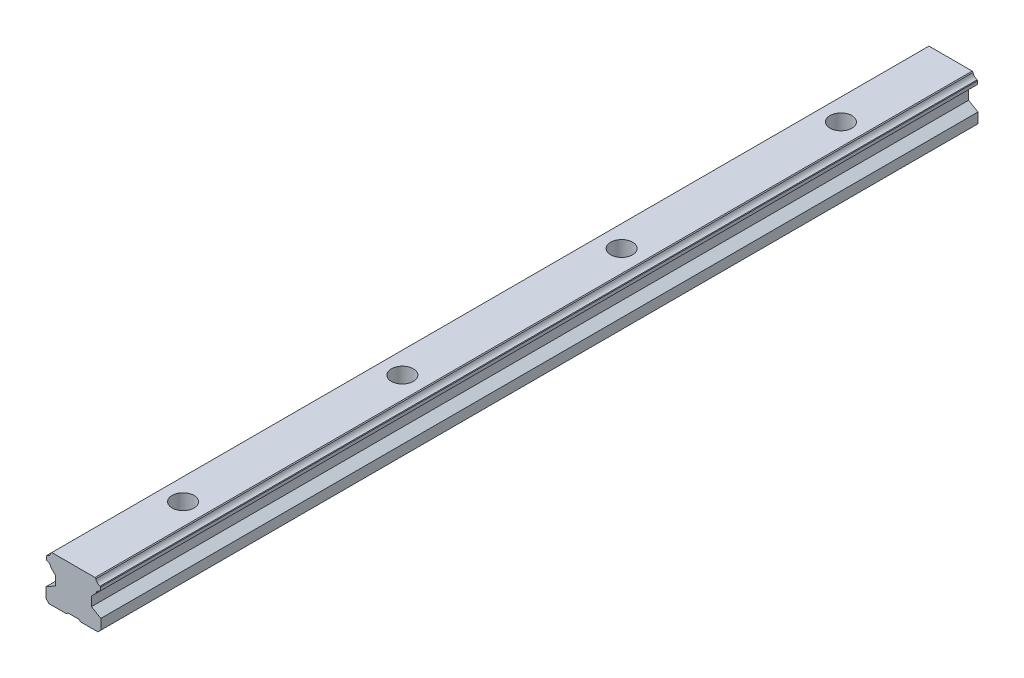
ISO-10303-21;
HEADER;
FILE_DESCRIPTION(('STEP AP214'),'2;1');
FILE_NAME('part.step','',(''),(''),'','','');
FILE_SCHEMA(('AUTOMOTIVE_DESIGN { 1 0 10303 214 1 1 1 1 }'));
ENDSEC;
DATA;
#1=APPLICATION_CONTEXT('core data for automotive mechanical design processes');
#2=APPLICATION_PROTOCOL_DEFINITION('international standard','automotive_design',2000,#1);
#3=PRODUCT_CONTEXT('',#1,'mechanical');
#4=PRODUCT('Part','Part','',(#3));
#5=PRODUCT_RELATED_PRODUCT_CATEGORY('part','',(#4));
#6=PRODUCT_DEFINITION_FORMATION('','',#4);
#7=PRODUCT_DEFINITION_CONTEXT('part definition',#1,'design');
#8=PRODUCT_DEFINITION('design','',#6,#7);
#9=PRODUCT_DEFINITION_SHAPE('','',#8);
#10=(LENGTH_UNIT() NAMED_UNIT(*) SI_UNIT(.MILLI.,.METRE.));
#11=(NAMED_UNIT(*) PLANE_ANGLE_UNIT() SI_UNIT($,.RADIAN.));
#12=(NAMED_UNIT(*) SI_UNIT($,.STERADIAN.) SOLID_ANGLE_UNIT());
#13=UNCERTAINTY_MEASURE_WITH_UNIT(LENGTH_MEASURE(1.E-05),#10,'distance_accuracy_value','');
#14=(GEOMETRIC_REPRESENTATION_CONTEXT(3) GLOBAL_UNCERTAINTY_ASSIGNED_CONTEXT((#13)) GLOBAL_UNIT_ASSIGNED_CONTEXT((#10,
#11,#12)) REPRESENTATION_CONTEXT('',''));
#15=CARTESIAN_POINT('',(0.,0.,0.));
#16=DIRECTION('',(0.,0.,1.));
#17=DIRECTION('',(1.,0.,0.));
#18=AXIS2_PLACEMENT_3D('',#15,#16,#17);
#19=CARTESIAN_POINT('',(-1.5000009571,-23.6,-150.901386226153));
#20=DIRECTION('',(0.,-1.,0.));
#21=DIRECTION('',(0.,0.,-1.));
#22=AXIS2_PLACEMENT_3D('',#19,#20,#21);
#23=PLANE('',#22);
#24=DIRECTION('',(0.,0.,-1.));
#25=VECTOR('',#24,1.);
#26=CARTESIAN_POINT('',(-1.50000095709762,-23.6,-150.901386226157));
#27=LINE('',#26,#25);
#28=CARTESIAN_POINT('',(-1.50000095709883,-23.6,-209.098613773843));
#29=VERTEX_POINT('',#28);
#30=CARTESIAN_POINT('',(-1.50000095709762,-23.6,-150.901386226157));
#31=VERTEX_POINT('',#30);
#32=EDGE_CURVE('E265',#29,#31,#27,.F.);
#33=ORIENTED_EDGE('',*,*,#32,.F.);
#34=CARTESIAN_POINT('',(0.,-23.6,-210.));
#35=DIRECTION('',(0.,1.,0.));
#36=DIRECTION('',(0.,0.,1.));
#37=AXIS2_PLACEMENT_3D('',#34,#35,#36);
#38=CIRCLE('',#37,1.75);
#39=CARTESIAN_POINT('',(1.50000054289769,-23.6,-209.098613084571));
#40=VERTEX_POINT('',#39);
#41=EDGE_CURVE('E252',#29,#40,#38,.T.);
#42=ORIENTED_EDGE('',*,*,#41,.T.);
#43=DIRECTION('',(0.,0.,1.));
#44=VECTOR('',#43,1.);
#45=CARTESIAN_POINT('',(1.50000054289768,-23.6,-209.098613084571));
#46=LINE('',#45,#44);
#47=CARTESIAN_POINT('',(1.50000054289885,-23.6,-150.901386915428));
#48=VERTEX_POINT('',#47);
#49=EDGE_CURVE('E264',#40,#48,#46,.T.);
#50=ORIENTED_EDGE('',*,*,#49,.T.);
#51=CARTESIAN_POINT('',(0.,-23.6,-150.));
#52=DIRECTION('',(0.,1.,0.));
#53=DIRECTION('',(0.,0.,-1.));
#54=AXIS2_PLACEMENT_3D('',#51,#52,#53);
#55=CIRCLE('',#54,1.75);
#56=EDGE_CURVE('E280',#48,#31,#55,.T.);
#57=ORIENTED_EDGE('',*,*,#56,.T.);
#58=EDGE_LOOP('',(#33,#42,#50,#57));
#59=FACE_BOUND('',#58,.T.);
#60=ADVANCED_FACE('F16',(#59),#23,.T.);
#61=CARTESIAN_POINT('',(-1.5000009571,-23.6,-90.9013862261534));
#62=DIRECTION('',(0.,-1.,0.));
#63=DIRECTION('',(0.,0.,-1.));
#64=AXIS2_PLACEMENT_3D('',#61,#62,#63);
#65=PLANE('',#64);
#66=DIRECTION('',(0.,0.,-1.));
#67=VECTOR('',#66,1.);
#68=CARTESIAN_POINT('',(-1.50000095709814,-23.6,-90.901386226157));
#69=LINE('',#68,#67);
#70=CARTESIAN_POINT('',(-1.50000095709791,-23.6,-149.098613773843));
#71=VERTEX_POINT('',#70);
#72=CARTESIAN_POINT('',(-1.50000095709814,-23.6,-90.901386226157));
#73=VERTEX_POINT('',#72);
#74=EDGE_CURVE('E291',#71,#73,#69,.F.);
#75=ORIENTED_EDGE('',*,*,#74,.F.);
#76=CARTESIAN_POINT('',(0.,-23.6,-150.));
#77=DIRECTION('',(0.,1.,0.));
#78=DIRECTION('',(0.,0.,1.));
#79=AXIS2_PLACEMENT_3D('',#76,#77,#78);
#80=CIRCLE('',#79,1.75);
#81=CARTESIAN_POINT('',(1.50000054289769,-23.6,-149.098613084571));
#82=VERTEX_POINT('',#81);
#83=EDGE_CURVE('E296',#71,#82,#80,.T.);
#84=ORIENTED_EDGE('',*,*,#83,.T.);
#85=DIRECTION('',(0.,0.,1.));
#86=VECTOR('',#85,1.);
#87=CARTESIAN_POINT('',(1.50000054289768,-23.6,-149.098613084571));
#88=LINE('',#87,#86);
#89=CARTESIAN_POINT('',(1.50000054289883,-23.6,-90.9013869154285));
#90=VERTEX_POINT('',#89);
#91=EDGE_CURVE('E301',#82,#90,#88,.T.);
#92=ORIENTED_EDGE('',*,*,#91,.T.);
#93=CARTESIAN_POINT('',(0.,-23.6,-90.));
#94=DIRECTION('',(0.,1.,0.));
#95=DIRECTION('',(0.,0.,-1.));
#96=AXIS2_PLACEMENT_3D('',#93,#94,#95);
#97=CIRCLE('',#96,1.75);
#98=EDGE_CURVE('E306',#90,#73,#97,.T.);
#99=ORIENTED_EDGE('',*,*,#98,.T.);
#100=EDGE_LOOP('',(#75,#84,#92,#99));
#101=FACE_BOUND('',#100,.T.);
#102=ADVANCED_FACE('F939',(#101),#65,.T.);
#103=CARTESIAN_POINT('',(-1.50000095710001,-23.6,-30.9013862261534));
#104=DIRECTION('',(0.,-1.,0.));
#105=DIRECTION('',(0.,0.,-1.));
#106=AXIS2_PLACEMENT_3D('',#103,#104,#105);
#107=PLANE('',#106);
#108=DIRECTION('',(0.,0.,-1.));
#109=VECTOR('',#108,1.);
#110=CARTESIAN_POINT('',(-1.50000095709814,-23.6,-30.901386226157));
#111=LINE('',#110,#109);
#112=CARTESIAN_POINT('',(-1.50000095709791,-23.6,-89.0986137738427));
#113=VERTEX_POINT('',#112);
#114=CARTESIAN_POINT('',(-1.50000095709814,-23.6,-30.901386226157));
#115=VERTEX_POINT('',#114);
#116=EDGE_CURVE('E311',#113,#115,#111,.F.);
#117=ORIENTED_EDGE('',*,*,#116,.F.);
#118=CARTESIAN_POINT('',(0.,-23.6,-90.));
#119=DIRECTION('',(0.,1.,0.));
#120=DIRECTION('',(0.,0.,1.));
#121=AXIS2_PLACEMENT_3D('',#118,#119,#120);
#122=CIRCLE('',#121,1.75);
#123=CARTESIAN_POINT('',(1.50000054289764,-23.6,-89.0986130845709));
#124=VERTEX_POINT('',#123);
#125=EDGE_CURVE('E316',#113,#124,#122,.T.);
#126=ORIENTED_EDGE('',*,*,#125,.T.);
#127=DIRECTION('',(0.,0.,1.));
#128=VECTOR('',#127,1.);
#129=CARTESIAN_POINT('',(1.50000054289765,-23.6,-89.0986130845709));
#130=LINE('',#129,#128);
#131=CARTESIAN_POINT('',(1.50000054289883,-23.6,-30.9013869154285));
#132=VERTEX_POINT('',#131);
#133=EDGE_CURVE('E321',#124,#132,#130,.T.);
#134=ORIENTED_EDGE('',*,*,#133,.T.);
#135=CARTESIAN_POINT('',(0.,-23.6,-30.));
#136=DIRECTION('',(0.,1.,0.));
#137=DIRECTION('',(0.,0.,-1.));
#138=AXIS2_PLACEMENT_3D('',#135,#136,#137);
#139=CIRCLE('',#138,1.75);
#140=EDGE_CURVE('E326',#132,#115,#139,.T.);
#141=ORIENTED_EDGE('',*,*,#140,.T.);
#142=EDGE_LOOP('',(#117,#126,#134,#141));
#143=FACE_BOUND('',#142,.T.);
#144=ADVANCED_FACE('F944',(#143),#107,.T.);
#145=CARTESIAN_POINT('',(-1.5000009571,-23.6,0.));
#146=DIRECTION('',(0.,-1.,0.));
#147=DIRECTION('',(0.,0.,-1.));
#148=AXIS2_PLACEMENT_3D('',#145,#146,#147);
#149=PLANE('',#148);
#150=DIRECTION('',(0.,0.,-1.));
#151=VECTOR('',#150,1.);
#152=CARTESIAN_POINT('',(-1.5000009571,-23.6,0.));
#153=LINE('',#152,#151);
#154=CARTESIAN_POINT('',(-1.50000095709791,-23.6,-29.0986137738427));
#155=VERTEX_POINT('',#154);
#156=CARTESIAN_POINT('',(-1.5000009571,-23.6,0.));
#157=VERTEX_POINT('',#156);
#158=EDGE_CURVE('E331',#155,#157,#153,.F.);
#159=ORIENTED_EDGE('',*,*,#158,.F.);
#160=CARTESIAN_POINT('',(0.,-23.6,-30.));
#161=DIRECTION('',(0.,1.,0.));
#162=DIRECTION('',(0.,0.,1.));
#163=AXIS2_PLACEMENT_3D('',#160,#161,#162);
#164=CIRCLE('',#163,1.75);
#165=CARTESIAN_POINT('',(1.50000054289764,-23.6,-29.0986130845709));
#166=VERTEX_POINT('',#165);
#167=EDGE_CURVE('E336',#155,#166,#164,.T.);
#168=ORIENTED_EDGE('',*,*,#167,.T.);
#169=DIRECTION('',(0.,0.,1.));
#170=VECTOR('',#169,1.);
#171=CARTESIAN_POINT('',(1.50000054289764,-23.6,-29.0986130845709));
#172=LINE('',#171,#170);
#173=CARTESIAN_POINT('',(1.5000005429,-23.6,0.));
#174=VERTEX_POINT('',#173);
#175=EDGE_CURVE('E341',#166,#174,#172,.T.);
#176=ORIENTED_EDGE('',*,*,#175,.T.);
#177=DIRECTION('',(-1.,0.,0.));
#178=VECTOR('',#177,1.);
#179=CARTESIAN_POINT('',(1.5000005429,-23.6,0.));
#180=LINE('',#179,#178);
#181=EDGE_CURVE('E346',#157,#174,#180,.F.);
#182=ORIENTED_EDGE('',*,*,#181,.F.);
#183=EDGE_LOOP('',(#159,#168,#176,#182));
#184=FACE_BOUND('',#183,.T.);
#185=ADVANCED_FACE('F950',(#184),#149,.T.);
#186=CARTESIAN_POINT('',(-7.4999994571,-23.2,-240.));
#187=DIRECTION('',(-1.,0.,0.));
#188=DIRECTION('',(0.,0.,1.));
#189=AXIS2_PLACEMENT_3D('',#186,#187,#188);
#190=PLANE('',#189);
#191=DIRECTION('',(0.,1.,0.));
#192=VECTOR('',#191,1.);
#193=CARTESIAN_POINT('',(-7.4999994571,-23.2,0.));
#194=LINE('',#193,#192);
#195=CARTESIAN_POINT('',(-7.4999994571,-20.4,0.));
#196=VERTEX_POINT('',#195);
#197=CARTESIAN_POINT('',(-7.4999994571,-23.2,0.));
#198=VERTEX_POINT('',#197);
#199=EDGE_CURVE('E350',#196,#198,#194,.F.);
#200=ORIENTED_EDGE('',*,*,#199,.F.);
#201=DIRECTION('',(0.,0.,-1.));
#202=VECTOR('',#201,1.);
#203=CARTESIAN_POINT('',(-7.4999994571,-20.4,0.));
#204=LINE('',#203,#202);
#205=CARTESIAN_POINT('',(-7.4999994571,-20.4,-240.));
#206=VERTEX_POINT('',#205);
#207=EDGE_CURVE('E354',#206,#196,#204,.F.);
#208=ORIENTED_EDGE('',*,*,#207,.F.);
#209=DIRECTION('',(0.,-1.,0.));
#210=VECTOR('',#209,1.);
#211=CARTESIAN_POINT('',(-7.4999994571,-20.4,-240.));
#212=LINE('',#211,#210);
#213=CARTESIAN_POINT('',(-7.4999994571,-23.2,-240.));
#214=VERTEX_POINT('',#213);
#215=EDGE_CURVE('E359',#206,#214,#212,.T.);
#216=ORIENTED_EDGE('',*,*,#215,.T.);
#217=DIRECTION('',(0.,0.,1.));
#218=VECTOR('',#217,1.);
#219=CARTESIAN_POINT('',(-7.4999994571,-23.2,-240.));
#220=LINE('',#219,#218);
#221=EDGE_CURVE('E364',#214,#198,#220,.T.);
#222=ORIENTED_EDGE('',*,*,#221,.T.);
#223=EDGE_LOOP('',(#200,#208,#216,#222));
#224=FACE_BOUND('',#223,.T.);
#225=ADVANCED_FACE('F954',(#224),#190,.T.);
#226=CARTESIAN_POINT('',(-7.4999994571,-23.2,-240.));
#227=DIRECTION('',(-0.707106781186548,-0.707106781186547,0.));
#228=DIRECTION('',(0.707106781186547,-0.707106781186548,0.));
#229=AXIS2_PLACEMENT_3D('',#226,#227,#228);
#230=PLANE('',#229);
#231=DIRECTION('',(-0.707106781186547,0.707106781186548,0.));
#232=VECTOR('',#231,1.);
#233=CARTESIAN_POINT('',(-6.6999994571,-24.,0.));
#234=LINE('',#233,#232);
#235=CARTESIAN_POINT('',(-6.6999994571,-24.,0.));
#236=VERTEX_POINT('',#235);
#237=EDGE_CURVE('E369',#198,#236,#234,.F.);
#238=ORIENTED_EDGE('',*,*,#237,.F.);
#239=ORIENTED_EDGE('',*,*,#221,.F.);
#240=DIRECTION('',(0.707106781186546,-0.707106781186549,0.));
#241=VECTOR('',#240,1.);
#242=CARTESIAN_POINT('',(-7.4999994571,-23.2,-240.));
#243=LINE('',#242,#241);
#244=CARTESIAN_POINT('',(-6.6999994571,-24.,-240.));
#245=VERTEX_POINT('',#244);
#246=EDGE_CURVE('E373',#214,#245,#243,.T.);
#247=ORIENTED_EDGE('',*,*,#246,.T.);
#248=DIRECTION('',(0.,0.,1.));
#249=VECTOR('',#248,1.);
#250=CARTESIAN_POINT('',(-6.6999994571,-24.,-240.));
#251=LINE('',#250,#249);
#252=EDGE_CURVE('E378',#245,#236,#251,.T.);
#253=ORIENTED_EDGE('',*,*,#252,.T.);
#254=EDGE_LOOP('',(#238,#239,#247,#253));
#255=FACE_BOUND('',#254,.T.);
#256=ADVANCED_FACE('F958',(#255),#230,.T.);
#257=CARTESIAN_POINT('',(-6.6999994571,-24.,0.));
#258=DIRECTION('',(0.,-1.,0.));
#259=DIRECTION('',(0.,0.,-1.));
#260=AXIS2_PLACEMENT_3D('',#257,#258,#259);
#261=PLANE('',#260);
#262=DIRECTION('',(-1.,0.,0.));
#263=VECTOR('',#262,1.);
#264=CARTESIAN_POINT('',(-1.8999999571,-24.,0.));
#265=LINE('',#264,#263);
#266=CARTESIAN_POINT('',(-1.8999999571,-24.,0.));
#267=VERTEX_POINT('',#266);
#268=EDGE_CURVE('E383',#236,#267,#265,.F.);
#269=ORIENTED_EDGE('',*,*,#268,.F.);
#270=ORIENTED_EDGE('',*,*,#252,.F.);
#271=DIRECTION('',(1.,0.,0.));
#272=VECTOR('',#271,1.);
#273=CARTESIAN_POINT('',(-6.6999994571,-24.,-240.));
#274=LINE('',#273,#272);
#275=CARTESIAN_POINT('',(-1.8999999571,-24.,-240.));
#276=VERTEX_POINT('',#275);
#277=EDGE_CURVE('E387',#245,#276,#274,.T.);
#278=ORIENTED_EDGE('',*,*,#277,.T.);
#279=DIRECTION('',(0.,0.,1.));
#280=VECTOR('',#279,1.);
#281=CARTESIAN_POINT('',(-1.8999999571,-24.,-240.));
#282=LINE('',#281,#280);
#283=EDGE_CURVE('E392',#276,#267,#282,.T.);
#284=ORIENTED_EDGE('',*,*,#283,.T.);
#285=EDGE_LOOP('',(#269,#270,#278,#284));
#286=FACE_BOUND('',#285,.T.);
#287=ADVANCED_FACE('F403',(#286),#261,.T.);
#288=CARTESIAN_POINT('',(-1.8999999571,-24.,-240.));
#289=DIRECTION('',(0.707107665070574,-0.707105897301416,0.));
#290=DIRECTION('',(0.707105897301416,0.707107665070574,0.));
#291=AXIS2_PLACEMENT_3D('',#288,#289,#290);
#292=PLANE('',#291);
#293=DIRECTION('',(0.,0.,1.));
#294=VECTOR('',#293,1.);
#295=CARTESIAN_POINT('',(-1.5000009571,-23.6,-240.));
#296=LINE('',#295,#294);
#297=CARTESIAN_POINT('',(-1.5000009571,-23.6,-240.));
#298=VERTEX_POINT('',#297);
#299=CARTESIAN_POINT('',(-1.50000095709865,-23.5999999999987,-210.901386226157));
#300=VERTEX_POINT('',#299);
#301=EDGE_CURVE('E275',#298,#300,#296,.T.);
#302=ORIENTED_EDGE('',*,*,#301,.T.);
#303=CARTESIAN_POINT('',(-1.50000095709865,-23.5999999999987,-210.901386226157));
#304=CARTESIAN_POINT('',(-1.53137600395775,-23.6313751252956,-210.849174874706));
#305=CARTESIAN_POINT('',(-1.56037218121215,-23.6603713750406,-210.79491922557));
#306=CARTESIAN_POINT('',(-1.62448524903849,-23.72448460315,-210.657284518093));
#307=CARTESIAN_POINT('',(-1.65801061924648,-23.7580100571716,-210.569857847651));
#308=CARTESIAN_POINT('',(-1.69891163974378,-23.7989111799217,-210.422387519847));
#309=CARTESIAN_POINT('',(-1.70994341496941,-23.8099429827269,-210.375848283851));
#310=CARTESIAN_POINT('',(-1.72789766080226,-23.8278972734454,-210.281470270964));
#311=CARTESIAN_POINT('',(-1.7354007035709,-23.8354003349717,-210.235733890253));
#312=CARTESIAN_POINT('',(-1.74344333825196,-23.8434429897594,-210.15300928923));
#313=CARTESIAN_POINT('',(-1.74488679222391,-23.84488644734,-210.135663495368));
#314=CARTESIAN_POINT('',(-1.74721065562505,-23.8472103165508,-210.100742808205));
#315=CARTESIAN_POINT('',(-1.74816445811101,-23.8481641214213,-210.0842008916));
#316=CARTESIAN_POINT('',(-1.74918618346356,-23.8491858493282,-210.054129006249));
#317=CARTESIAN_POINT('',(-1.74936675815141,-23.8493664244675,-210.047922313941));
#318=CARTESIAN_POINT('',(-1.74965635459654,-23.8496560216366,-210.035459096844));
#319=CARTESIAN_POINT('',(-1.74977443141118,-23.8497740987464,-210.029589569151));
#320=CARTESIAN_POINT('',(-1.74992032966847,-23.8499199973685,-210.017284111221));
#321=CARTESIAN_POINT('',(-1.74995335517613,-23.8499530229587,-210.015073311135));
#322=CARTESIAN_POINT('',(-1.74998893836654,-23.8499886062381,-210.006350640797));
#323=CARTESIAN_POINT('',(-1.74999173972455,-23.8499914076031,-210.005198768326));
#324=CARTESIAN_POINT('',(-1.7499954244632,-23.8499950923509,-210.002670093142));
#325=CARTESIAN_POINT('',(-1.74999630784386,-23.8499959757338,-210.001293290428));
#326=CARTESIAN_POINT('',(-1.74999618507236,-23.849995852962,-209.998543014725));
#327=CARTESIAN_POINT('',(-1.7499951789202,-23.8499948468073,-209.997169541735));
#328=CARTESIAN_POINT('',(-1.74999130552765,-23.8499909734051,-209.994654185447));
#329=CARTESIAN_POINT('',(-1.74998843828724,-23.8499881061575,-209.993512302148));
#330=CARTESIAN_POINT('',(-1.74993741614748,-23.8499370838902,-209.981214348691));
#331=CARTESIAN_POINT('',(-1.74989231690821,-23.8498919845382,-209.97982599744));
#332=CARTESIAN_POINT('',(-1.74962647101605,-23.8496261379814,-209.960883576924));
#333=CARTESIAN_POINT('',(-1.74940753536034,-23.8494072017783,-209.953301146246));
#334=CARTESIAN_POINT('',(-1.74845980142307,-23.8484594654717,-209.92288130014));
#335=CARTESIAN_POINT('',(-1.74766239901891,-23.8476620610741,-209.907748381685));
#336=CARTESIAN_POINT('',(-1.74396706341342,-23.8439667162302,-209.847021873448));
#337=CARTESIAN_POINT('',(-1.7407038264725,-23.8407034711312,-209.816588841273));
#338=CARTESIAN_POINT('',(-1.73150044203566,-23.8315000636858,-209.741683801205));
#339=CARTESIAN_POINT('',(-1.72507743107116,-23.8250770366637,-209.702817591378));
#340=CARTESIAN_POINT('',(-1.70186460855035,-23.8018641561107,-209.583965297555));
#341=CARTESIAN_POINT('',(-1.68354832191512,-23.7835478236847,-209.517564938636));
#342=CARTESIAN_POINT('',(-1.61632757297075,-23.716326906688,-209.312798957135));
#343=CARTESIAN_POINT('',(-1.56137125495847,-23.6613704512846,-209.200740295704));
#344=CARTESIAN_POINT('',(-1.50000095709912,-23.5999999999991,-209.098613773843));
#345=B_SPLINE_CURVE_WITH_KNOTS('',3,(#303,#304,#305,#306,#307,#308,#309,#310,#311,#312,#313,
#314,#315,#316,#317,#318,#319,#320,#321,#322,#323,#324,#325,#326,#327,#328,#329,#330,#331,#332,
#333,#334,#335,#336,#337,#338,#339,#340,#341,#342,#343,#344),.UNSPECIFIED.,.F.,.F.,(4,2,2,2,2,2,
2,2,2,2,2,2,2,2,2,2,2,2,2,2,4),(0.,0.101317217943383,0.246634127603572,0.311107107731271,
0.369424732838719,0.384454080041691,0.39768690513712,0.401036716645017,0.403962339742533,
0.405282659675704,0.405439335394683,0.405596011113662,0.405752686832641,0.405909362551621,
0.407865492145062,0.413624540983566,0.428379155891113,0.473550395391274,0.540283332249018,
0.68522258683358,1.),.UNSPECIFIED.);
#346=EDGE_CURVE('E255',#300,#29,#345,.T.);
#347=ORIENTED_EDGE('',*,*,#346,.T.);
#348=ORIENTED_EDGE('',*,*,#32,.T.);
#349=CARTESIAN_POINT('',(-1.50000095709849,-23.5999999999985,-150.901386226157));
#350=CARTESIAN_POINT('',(-1.53137600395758,-23.6313751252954,-150.849174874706));
#351=CARTESIAN_POINT('',(-1.56037218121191,-23.6603713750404,-150.79491922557));
#352=CARTESIAN_POINT('',(-1.62448524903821,-23.7244846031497,-150.657284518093));
#353=CARTESIAN_POINT('',(-1.65801061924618,-23.7580100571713,-150.569857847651));
#354=CARTESIAN_POINT('',(-1.69891163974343,-23.7989111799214,-150.422387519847));
#355=CARTESIAN_POINT('',(-1.70994341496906,-23.8099429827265,-150.375848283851));
#356=CARTESIAN_POINT('',(-1.72789766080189,-23.8278972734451,-150.281470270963));
#357=CARTESIAN_POINT('',(-1.73540070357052,-23.8354003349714,-150.235733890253));
#358=CARTESIAN_POINT('',(-1.74344333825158,-23.8434429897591,-150.15300928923));
#359=CARTESIAN_POINT('',(-1.74488679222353,-23.8448864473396,-150.135663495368));
#360=CARTESIAN_POINT('',(-1.74721065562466,-23.8472103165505,-150.100742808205));
#361=CARTESIAN_POINT('',(-1.74816445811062,-23.8481641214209,-150.0842008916));
#362=CARTESIAN_POINT('',(-1.74918618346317,-23.8491858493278,-150.054129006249));
#363=CARTESIAN_POINT('',(-1.74936675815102,-23.8493664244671,-150.047922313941));
#364=CARTESIAN_POINT('',(-1.74965635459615,-23.8496560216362,-150.035459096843));
#365=CARTESIAN_POINT('',(-1.74977443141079,-23.849774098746,-150.02958956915));
#366=CARTESIAN_POINT('',(-1.74992032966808,-23.8499199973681,-150.017284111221));
#367=CARTESIAN_POINT('',(-1.74995335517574,-23.8499530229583,-150.015073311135));
#368=CARTESIAN_POINT('',(-1.74998893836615,-23.8499886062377,-150.006350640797));
#369=CARTESIAN_POINT('',(-1.74999173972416,-23.8499914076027,-150.005198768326));
#370=CARTESIAN_POINT('',(-1.74999542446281,-23.8499950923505,-150.002670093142));
#371=CARTESIAN_POINT('',(-1.74999630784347,-23.8499959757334,-150.001293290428));
#372=CARTESIAN_POINT('',(-1.74999618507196,-23.8499958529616,-149.998543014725));
#373=CARTESIAN_POINT('',(-1.74999517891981,-23.8499948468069,-149.997169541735));
#374=CARTESIAN_POINT('',(-1.74999130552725,-23.8499909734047,-149.994654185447));
#375=CARTESIAN_POINT('',(-1.74998843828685,-23.8499881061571,-149.993512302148));
#376=CARTESIAN_POINT('',(-1.74993741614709,-23.8499370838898,-149.981214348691));
#377=CARTESIAN_POINT('',(-1.74989231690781,-23.8498919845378,-149.979825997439));
#378=CARTESIAN_POINT('',(-1.74962647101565,-23.849626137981,-149.960883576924));
#379=CARTESIAN_POINT('',(-1.74940753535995,-23.849407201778,-149.953301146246));
#380=CARTESIAN_POINT('',(-1.74845980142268,-23.8484594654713,-149.92288130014));
#381=CARTESIAN_POINT('',(-1.74766239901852,-23.8476620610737,-149.907748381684));
#382=CARTESIAN_POINT('',(-1.74396706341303,-23.8439667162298,-149.847021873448));
#383=CARTESIAN_POINT('',(-1.7407038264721,-23.8407034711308,-149.816588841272));
#384=CARTESIAN_POINT('',(-1.73150044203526,-23.8315000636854,-149.741683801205));
#385=CARTESIAN_POINT('',(-1.72507743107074,-23.8250770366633,-149.702817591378));
#386=CARTESIAN_POINT('',(-1.7018646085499,-23.8018641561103,-149.583965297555));
#387=CARTESIAN_POINT('',(-1.68354832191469,-23.7835478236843,-149.517564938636));
#388=CARTESIAN_POINT('',(-1.61632757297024,-23.7163269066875,-149.312798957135));
#389=CARTESIAN_POINT('',(-1.56137125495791,-23.661370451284,-149.200740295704));
#390=CARTESIAN_POINT('',(-1.5000009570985,-23.5999999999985,-149.098613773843));
#391=B_SPLINE_CURVE_WITH_KNOTS('',3,(#349,#350,#351,#352,#353,#354,#355,#356,#357,#358,#359,
#360,#361,#362,#363,#364,#365,#366,#367,#368,#369,#370,#371,#372,#373,#374,#375,#376,#377,#378,
#379,#380,#381,#382,#383,#384,#385,#386,#387,#388,#389,#390),.UNSPECIFIED.,.F.,.F.,(4,2,2,2,2,2,
2,2,2,2,2,2,2,2,2,2,2,2,2,2,4),(0.,0.10131721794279,0.246634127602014,0.311107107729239,
0.369424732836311,0.384454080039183,0.397686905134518,0.401036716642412,0.403962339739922,
0.405282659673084,0.405439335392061,0.40559601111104,0.405752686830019,0.405909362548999,
0.407865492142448,0.413624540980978,0.428379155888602,0.473550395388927,0.540283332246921,
0.685222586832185,1.),.UNSPECIFIED.);
#392=EDGE_CURVE('E276',#31,#71,#391,.T.);
#393=ORIENTED_EDGE('',*,*,#392,.T.);
#394=ORIENTED_EDGE('',*,*,#74,.T.);
#395=CARTESIAN_POINT('',(-1.50000095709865,-23.5999999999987,-90.9013862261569));
#396=CARTESIAN_POINT('',(-1.53137600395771,-23.6313751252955,-90.8491748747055));
#397=CARTESIAN_POINT('',(-1.56037218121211,-23.6603713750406,-90.7949192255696));
#398=CARTESIAN_POINT('',(-1.62448524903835,-23.7244846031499,-90.657284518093));
#399=CARTESIAN_POINT('',(-1.65801061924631,-23.7580100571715,-90.5698578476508));
#400=CARTESIAN_POINT('',(-1.69891163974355,-23.7989111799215,-90.4223875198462));
#401=CARTESIAN_POINT('',(-1.70994341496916,-23.8099429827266,-90.3758482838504));
#402=CARTESIAN_POINT('',(-1.72789766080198,-23.8278972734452,-90.2814702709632));
#403=CARTESIAN_POINT('',(-1.73540070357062,-23.8354003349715,-90.2357338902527));
#404=CARTESIAN_POINT('',(-1.74344333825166,-23.8434429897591,-90.1530092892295));
#405=CARTESIAN_POINT('',(-1.74488679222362,-23.8448864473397,-90.1356634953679));
#406=CARTESIAN_POINT('',(-1.74721065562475,-23.8472103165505,-90.1007428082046));
#407=CARTESIAN_POINT('',(-1.74816445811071,-23.848164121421,-90.0842008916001));
#408=CARTESIAN_POINT('',(-1.74918618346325,-23.8491858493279,-90.0541290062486));
#409=CARTESIAN_POINT('',(-1.7493667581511,-23.8493664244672,-90.047922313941));
#410=CARTESIAN_POINT('',(-1.74965635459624,-23.8496560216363,-90.0354590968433));
#411=CARTESIAN_POINT('',(-1.74977443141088,-23.8497740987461,-90.0295895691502));
#412=CARTESIAN_POINT('',(-1.74992032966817,-23.8499199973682,-90.0172841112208));
#413=CARTESIAN_POINT('',(-1.74995335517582,-23.8499530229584,-90.0150733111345));
#414=CARTESIAN_POINT('',(-1.74998893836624,-23.8499886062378,-90.0063506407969));
#415=CARTESIAN_POINT('',(-1.74999173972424,-23.8499914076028,-90.0051987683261));
#416=CARTESIAN_POINT('',(-1.7499954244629,-23.8499950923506,-90.0026700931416));
#417=CARTESIAN_POINT('',(-1.74999630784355,-23.8499959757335,-90.0012932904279));
#418=CARTESIAN_POINT('',(-1.74999618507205,-23.8499958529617,-89.9985430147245));
#419=CARTESIAN_POINT('',(-1.7499951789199,-23.849994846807,-89.9971695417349));
#420=CARTESIAN_POINT('',(-1.74999130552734,-23.8499909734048,-89.9946541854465));
#421=CARTESIAN_POINT('',(-1.74998843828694,-23.8499881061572,-89.9935123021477));
#422=CARTESIAN_POINT('',(-1.74993741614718,-23.8499370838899,-89.9812143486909));
#423=CARTESIAN_POINT('',(-1.7498923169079,-23.8498919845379,-89.9798259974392));
#424=CARTESIAN_POINT('',(-1.74962647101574,-23.8496261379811,-89.9608835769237));
#425=CARTESIAN_POINT('',(-1.74940753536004,-23.849407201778,-89.9533011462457));
#426=CARTESIAN_POINT('',(-1.74845980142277,-23.8484594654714,-89.9228813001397));
#427=CARTESIAN_POINT('',(-1.7476623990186,-23.8476620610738,-89.9077483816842));
#428=CARTESIAN_POINT('',(-1.74396706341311,-23.8439667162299,-89.8470218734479));
#429=CARTESIAN_POINT('',(-1.74070382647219,-23.8407034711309,-89.8165888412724));
#430=CARTESIAN_POINT('',(-1.73150044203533,-23.8315000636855,-89.741683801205));
#431=CARTESIAN_POINT('',(-1.72507743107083,-23.8250770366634,-89.7028175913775));
#432=CARTESIAN_POINT('',(-1.70186460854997,-23.8018641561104,-89.5839652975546));
#433=CARTESIAN_POINT('',(-1.68354832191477,-23.7835478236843,-89.5175649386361));
#434=CARTESIAN_POINT('',(-1.61632757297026,-23.7163269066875,-89.3127989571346));
#435=CARTESIAN_POINT('',(-1.56137125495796,-23.6613704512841,-89.2007402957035));
#436=CARTESIAN_POINT('',(-1.5000009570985,-23.5999999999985,-89.0986137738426));
#437=B_SPLINE_CURVE_WITH_KNOTS('',3,(#395,#396,#397,#398,#399,#400,#401,#402,#403,#404,#405,
#406,#407,#408,#409,#410,#411,#412,#413,#414,#415,#416,#417,#418,#419,#420,#421,#422,#423,#424,
#425,#426,#427,#428,#429,#430,#431,#432,#433,#434,#435,#436),.UNSPECIFIED.,.F.,.F.,(4,2,2,2,2,2,
2,2,2,2,2,2,2,2,2,2,2,2,2,2,4),(0.,0.101317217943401,0.2466341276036,0.311107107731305,
0.36942473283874,0.384454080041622,0.397686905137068,0.401036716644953,0.403962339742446,
0.405282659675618,0.405439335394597,0.405596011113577,0.405752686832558,0.405909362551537,
0.407865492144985,0.413624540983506,0.428379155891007,0.473550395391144,0.540283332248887,
0.685222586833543,1.),.UNSPECIFIED.);
#438=EDGE_CURVE('E415',#73,#113,#437,.T.);
#439=ORIENTED_EDGE('',*,*,#438,.T.);
#440=ORIENTED_EDGE('',*,*,#116,.T.);
#441=CARTESIAN_POINT('',(-1.50000095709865,-23.5999999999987,-30.9013862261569));
#442=CARTESIAN_POINT('',(-1.53137600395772,-23.6313751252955,-30.8491748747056));
#443=CARTESIAN_POINT('',(-1.5603721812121,-23.6603713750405,-30.7949192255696));
#444=CARTESIAN_POINT('',(-1.62448524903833,-23.7244846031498,-30.6572845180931));
#445=CARTESIAN_POINT('',(-1.65801061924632,-23.7580100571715,-30.5698578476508));
#446=CARTESIAN_POINT('',(-1.69891163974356,-23.7989111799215,-30.4223875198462));
#447=CARTESIAN_POINT('',(-1.70994341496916,-23.8099429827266,-30.3758482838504));
#448=CARTESIAN_POINT('',(-1.72789766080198,-23.8278972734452,-30.2814702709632));
#449=CARTESIAN_POINT('',(-1.73540070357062,-23.8354003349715,-30.2357338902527));
#450=CARTESIAN_POINT('',(-1.74344333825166,-23.8434429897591,-30.1530092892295));
#451=CARTESIAN_POINT('',(-1.74488679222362,-23.8448864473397,-30.1356634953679));
#452=CARTESIAN_POINT('',(-1.74721065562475,-23.8472103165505,-30.1007428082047));
#453=CARTESIAN_POINT('',(-1.74816445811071,-23.848164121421,-30.0842008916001));
#454=CARTESIAN_POINT('',(-1.74918618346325,-23.8491858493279,-30.0541290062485));
#455=CARTESIAN_POINT('',(-1.7493667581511,-23.8493664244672,-30.047922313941));
#456=CARTESIAN_POINT('',(-1.74965635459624,-23.8496560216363,-30.0354590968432));
#457=CARTESIAN_POINT('',(-1.74977443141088,-23.8497740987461,-30.0295895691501));
#458=CARTESIAN_POINT('',(-1.74992032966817,-23.8499199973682,-30.0172841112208));
#459=CARTESIAN_POINT('',(-1.74995335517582,-23.8499530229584,-30.0150733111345));
#460=CARTESIAN_POINT('',(-1.74998893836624,-23.8499886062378,-30.0063506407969));
#461=CARTESIAN_POINT('',(-1.74999173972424,-23.8499914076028,-30.0051987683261));
#462=CARTESIAN_POINT('',(-1.7499954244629,-23.8499950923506,-30.0026700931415));
#463=CARTESIAN_POINT('',(-1.74999630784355,-23.8499959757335,-30.0012932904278));
#464=CARTESIAN_POINT('',(-1.74999618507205,-23.8499958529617,-29.9985430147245));
#465=CARTESIAN_POINT('',(-1.7499951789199,-23.849994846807,-29.9971695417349));
#466=CARTESIAN_POINT('',(-1.74999130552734,-23.8499909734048,-29.9946541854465));
#467=CARTESIAN_POINT('',(-1.74998843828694,-23.8499881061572,-29.9935123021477));
#468=CARTESIAN_POINT('',(-1.74993741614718,-23.8499370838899,-29.9812143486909));
#469=CARTESIAN_POINT('',(-1.7498923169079,-23.8498919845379,-29.9798259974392));
#470=CARTESIAN_POINT('',(-1.74962647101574,-23.8496261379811,-29.9608835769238));
#471=CARTESIAN_POINT('',(-1.74940753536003,-23.849407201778,-29.9533011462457));
#472=CARTESIAN_POINT('',(-1.74845980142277,-23.8484594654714,-29.9228813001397));
#473=CARTESIAN_POINT('',(-1.7476623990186,-23.8476620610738,-29.9077483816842));
#474=CARTESIAN_POINT('',(-1.74396706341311,-23.8439667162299,-29.8470218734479));
#475=CARTESIAN_POINT('',(-1.74070382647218,-23.8407034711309,-29.8165888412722));
#476=CARTESIAN_POINT('',(-1.73150044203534,-23.8315000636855,-29.7416838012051));
#477=CARTESIAN_POINT('',(-1.72507743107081,-23.8250770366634,-29.7028175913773));
#478=CARTESIAN_POINT('',(-1.70186460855,-23.8018641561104,-29.5839652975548));
#479=CARTESIAN_POINT('',(-1.68354832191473,-23.7835478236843,-29.5175649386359));
#480=CARTESIAN_POINT('',(-1.6163275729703,-23.7163269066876,-29.3127989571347));
#481=CARTESIAN_POINT('',(-1.56137125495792,-23.661370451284,-29.2007402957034));
#482=CARTESIAN_POINT('',(-1.5000009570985,-23.5999999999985,-29.0986137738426));
#483=B_SPLINE_CURVE_WITH_KNOTS('',3,(#441,#442,#443,#444,#445,#446,#447,#448,#449,#450,#451,
#452,#453,#454,#455,#456,#457,#458,#459,#460,#461,#462,#463,#464,#465,#466,#467,#468,#469,#470,
#471,#472,#473,#474,#475,#476,#477,#478,#479,#480,#481,#482),.UNSPECIFIED.,.F.,.F.,(4,2,2,2,2,2,
2,2,2,2,2,2,2,2,2,2,2,2,2,2,4),(0.,0.101317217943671,0.246634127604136,0.311107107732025,
0.369424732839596,0.384454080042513,0.397686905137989,0.40103671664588,0.403962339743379,
0.405282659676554,0.405439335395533,0.405596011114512,0.405752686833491,0.405909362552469,
0.407865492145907,0.413624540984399,0.428379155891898,0.473550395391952,0.540283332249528,
0.68522258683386,1.),.UNSPECIFIED.);
#484=EDGE_CURVE('E411',#115,#155,#483,.T.);
#485=ORIENTED_EDGE('',*,*,#484,.T.);
#486=ORIENTED_EDGE('',*,*,#158,.T.);
#487=DIRECTION('',(-0.707105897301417,-0.707107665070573,0.));
#488=VECTOR('',#487,1.);
#489=CARTESIAN_POINT('',(-1.5000009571,-23.6,0.));
#490=LINE('',#489,#488);
#491=EDGE_CURVE('E407',#267,#157,#490,.F.);
#492=ORIENTED_EDGE('',*,*,#491,.F.);
#493=ORIENTED_EDGE('',*,*,#283,.F.);
#494=DIRECTION('',(0.707105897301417,0.707107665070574,0.));
#495=VECTOR('',#494,1.);
#496=CARTESIAN_POINT('',(-1.8999999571,-24.,-240.));
#497=LINE('',#496,#495);
#498=EDGE_CURVE('E406',#276,#298,#497,.T.);
#499=ORIENTED_EDGE('',*,*,#498,.T.);
#500=EDGE_LOOP('',(#302,#347,#348,#393,#394,#439,#440,#485,#486,#492,#493,#499));
#501=FACE_BOUND('',#500,.T.);
#502=ADVANCED_FACE('F271',(#501),#292,.T.);
#503=CARTESIAN_POINT('',(-1.5000009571,-23.6,-210.901386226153));
#504=DIRECTION('',(0.,-1.,0.));
#505=DIRECTION('',(0.,0.,-1.));
#506=AXIS2_PLACEMENT_3D('',#503,#504,#505);
#507=PLANE('',#506);
#508=DIRECTION('',(0.,0.,1.));
#509=VECTOR('',#508,1.);
#510=CARTESIAN_POINT('',(1.5000005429,-23.6,-240.));
#511=LINE('',#510,#509);
#512=CARTESIAN_POINT('',(1.5000005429,-23.6,-240.));
#513=VERTEX_POINT('',#512);
#514=CARTESIAN_POINT('',(1.50000054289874,-23.6,-210.901386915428));
#515=VERTEX_POINT('',#514);
#516=EDGE_CURVE('E413',#513,#515,#511,.T.);
#517=ORIENTED_EDGE('',*,*,#516,.T.);
#518=CARTESIAN_POINT('',(0.,-23.6,-210.));
#519=DIRECTION('',(0.,1.,0.));
#520=DIRECTION('',(0.,0.,-1.));
#521=AXIS2_PLACEMENT_3D('',#518,#519,#520);
#522=CIRCLE('',#521,1.75);
#523=EDGE_CURVE('E428',#515,#300,#522,.T.);
#524=ORIENTED_EDGE('',*,*,#523,.T.);
#525=ORIENTED_EDGE('',*,*,#301,.F.);
#526=DIRECTION('',(1.,0.,0.));
#527=VECTOR('',#526,1.);
#528=CARTESIAN_POINT('',(-1.5000009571,-23.6,-240.));
#529=LINE('',#528,#527);
#530=EDGE_CURVE('E432',#298,#513,#529,.T.);
#531=ORIENTED_EDGE('',*,*,#530,.T.);
#532=EDGE_LOOP('',(#517,#524,#525,#531));
#533=FACE_BOUND('',#532,.T.);
#534=ADVANCED_FACE('F459',(#533),#507,.T.);
#535=CARTESIAN_POINT('',(1.5000005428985,-23.5999999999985,-240.));
#536=DIRECTION('',(-0.707106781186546,-0.70710678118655,0.));
#537=DIRECTION('',(0.70710678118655,-0.707106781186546,0.));
#538=AXIS2_PLACEMENT_3D('',#535,#536,#537);
#539=PLANE('',#538);
#540=ORIENTED_EDGE('',*,*,#49,.F.);
#541=CARTESIAN_POINT('',(1.50000054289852,-23.5999999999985,-209.098613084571));
#542=CARTESIAN_POINT('',(1.53137564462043,-23.6313751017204,-209.150824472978));
#543=CARTESIAN_POINT('',(1.5603718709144,-23.6603713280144,-209.205080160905));
#544=CARTESIAN_POINT('',(1.62448504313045,-23.7244845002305,-209.342714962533));
#545=CARTESIAN_POINT('',(1.65801046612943,-23.7580099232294,-209.430141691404));
#546=CARTESIAN_POINT('',(1.69891155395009,-23.7989110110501,-209.577612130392));
#547=CARTESIAN_POINT('',(1.70994334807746,-23.8099428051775,-209.624151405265));
#548=CARTESIAN_POINT('',(1.72789762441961,-23.8278970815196,-209.718529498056));
#549=CARTESIAN_POINT('',(1.73540067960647,-23.8354001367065,-209.764265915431));
#550=CARTESIAN_POINT('',(1.74344332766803,-23.843442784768,-209.846990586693));
#551=CARTESIAN_POINT('',(1.74488678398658,-23.8448862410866,-209.864336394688));
#552=CARTESIAN_POINT('',(1.74721065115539,-23.8472101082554,-209.899257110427));
#553=CARTESIAN_POINT('',(1.74816445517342,-23.8481639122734,-209.915799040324));
#554=CARTESIAN_POINT('',(1.7491861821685,-23.8491856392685,-209.945870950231));
#555=CARTESIAN_POINT('',(1.74936675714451,-23.8493662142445,-209.952077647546));
#556=CARTESIAN_POINT('',(1.74965635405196,-23.849655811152,-209.964540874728));
#557=CARTESIAN_POINT('',(1.74977443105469,-23.8497738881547,-209.970410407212));
#558=CARTESIAN_POINT('',(1.74992032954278,-23.8499197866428,-209.982715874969));
#559=CARTESIAN_POINT('',(1.7499533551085,-23.8499528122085,-209.984926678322));
#560=CARTESIAN_POINT('',(1.7499889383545,-23.8499883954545,-209.993649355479));
#561=CARTESIAN_POINT('',(1.74999173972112,-23.8499911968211,-209.994801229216));
#562=CARTESIAN_POINT('',(1.74999542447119,-23.8499948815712,-209.997329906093));
#563=CARTESIAN_POINT('',(1.74999630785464,-23.8499957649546,-209.998706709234));
#564=CARTESIAN_POINT('',(1.74999618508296,-23.849995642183,-210.001456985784));
#565=CARTESIAN_POINT('',(1.74999517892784,-23.8499946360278,-210.002830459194));
#566=CARTESIAN_POINT('',(1.74999130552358,-23.8499907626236,-210.005345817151));
#567=CARTESIAN_POINT('',(1.74998843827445,-23.8499878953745,-210.006487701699));
#568=CARTESIAN_POINT('',(1.74993741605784,-23.8499368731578,-210.01878566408));
#569=CARTESIAN_POINT('',(1.74989231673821,-23.8498917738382,-210.020174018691));
#570=CARTESIAN_POINT('',(1.74962647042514,-23.8496259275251,-210.039116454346));
#571=CARTESIAN_POINT('',(1.74940753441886,-23.8494069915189,-210.046698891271));
#572=CARTESIAN_POINT('',(1.74845979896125,-23.8484592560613,-210.077118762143));
#573=CARTESIAN_POINT('',(1.74766239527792,-23.8476618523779,-210.092251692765));
#574=CARTESIAN_POINT('',(1.74396705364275,-23.8439665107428,-210.152978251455));
#575=CARTESIAN_POINT('',(1.74070381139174,-23.8407032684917,-210.183411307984));
#576=CARTESIAN_POINT('',(1.73150041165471,-23.8314998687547,-210.258316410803));
#577=CARTESIAN_POINT('',(1.72507738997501,-23.825076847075,-210.297182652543));
#578=CARTESIAN_POINT('',(1.70186452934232,-23.8018639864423,-210.416035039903));
#579=CARTESIAN_POINT('',(1.68354821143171,-23.7835476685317,-210.482435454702));
#580=CARTESIAN_POINT('',(1.61632735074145,-23.7163268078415,-210.687201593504));
#581=CARTESIAN_POINT('',(1.56137094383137,-23.6613704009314,-210.799260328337));
#582=CARTESIAN_POINT('',(1.50000054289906,-23.5999999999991,-210.901386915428));
#583=B_SPLINE_CURVE_WITH_KNOTS('',3,(#541,#542,#543,#544,#545,#546,#547,#548,#549,#550,#551,
#552,#553,#554,#555,#556,#557,#558,#559,#560,#561,#562,#563,#564,#565,#566,#567,#568,#569,#570,
#571,#572,#573,#574,#575,#576,#577,#578,#579,#580,#581,#582),.UNSPECIFIED.,.F.,.F.,(4,2,2,2,2,2,
2,2,2,2,2,2,2,2,2,2,2,2,2,2,4),(0.,0.101317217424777,0.24663412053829,0.311107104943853,
0.369424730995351,0.3844540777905,0.397686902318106,0.401036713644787,0.403962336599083,
0.405282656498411,0.405439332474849,0.405596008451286,0.405752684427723,0.405909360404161,
0.407865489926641,0.413624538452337,0.428379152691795,0.473550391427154,0.540283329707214,
0.685222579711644,1.),.UNSPECIFIED.);
#584=EDGE_CURVE('E258',#40,#515,#583,.T.);
#585=ORIENTED_EDGE('',*,*,#584,.T.);
#586=ORIENTED_EDGE('',*,*,#516,.F.);
#587=DIRECTION('',(0.707106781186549,-0.707106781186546,0.));
#588=VECTOR('',#587,1.);
#589=CARTESIAN_POINT('',(1.5000005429,-23.6,-240.));
#590=LINE('',#589,#588);
#591=CARTESIAN_POINT('',(1.9000005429,-24.,-240.));
#592=VERTEX_POINT('',#591);
#593=EDGE_CURVE('E446',#513,#592,#590,.T.);
#594=ORIENTED_EDGE('',*,*,#593,.T.);
#595=DIRECTION('',(0.,0.,1.));
#596=VECTOR('',#595,1.);
#597=CARTESIAN_POINT('',(1.9000005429,-24.,-240.));
#598=LINE('',#597,#596);
#599=CARTESIAN_POINT('',(1.9000005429,-24.,0.));
#600=VERTEX_POINT('',#599);
#601=EDGE_CURVE('E494',#592,#600,#598,.T.);
#602=ORIENTED_EDGE('',*,*,#601,.T.);
#603=DIRECTION('',(-0.707106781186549,0.707106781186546,-1.00485917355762E-13));
#604=VECTOR('',#603,1.);
#605=CARTESIAN_POINT('',(1.9000005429,-24.,0.));
#606=LINE('',#605,#604);
#607=EDGE_CURVE('E491',#174,#600,#606,.F.);
#608=ORIENTED_EDGE('',*,*,#607,.F.);
#609=ORIENTED_EDGE('',*,*,#175,.F.);
#610=CARTESIAN_POINT('',(1.5000005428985,-23.5999999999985,-29.0986130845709));
#611=CARTESIAN_POINT('',(1.53137564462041,-23.6313751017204,-29.1508244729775));
#612=CARTESIAN_POINT('',(1.56037187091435,-23.6603713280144,-29.2050801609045));
#613=CARTESIAN_POINT('',(1.62448504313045,-23.7244845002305,-29.3427149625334));
#614=CARTESIAN_POINT('',(1.6580104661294,-23.7580099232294,-29.4301416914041));
#615=CARTESIAN_POINT('',(1.69891155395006,-23.7989110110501,-29.5776121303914));
#616=CARTESIAN_POINT('',(1.7099433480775,-23.8099428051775,-29.6241514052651));
#617=CARTESIAN_POINT('',(1.72789762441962,-23.8278970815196,-29.7185294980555));
#618=CARTESIAN_POINT('',(1.7354006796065,-23.8354001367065,-29.7642659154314));
#619=CARTESIAN_POINT('',(1.74344332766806,-23.8434427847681,-29.8469905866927));
#620=CARTESIAN_POINT('',(1.74488678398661,-23.8448862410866,-29.8643363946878));
#621=CARTESIAN_POINT('',(1.74721065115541,-23.8472101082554,-29.899257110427));
#622=CARTESIAN_POINT('',(1.74816445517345,-23.8481639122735,-29.9157990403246));
#623=CARTESIAN_POINT('',(1.74918618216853,-23.8491856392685,-29.9458709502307));
#624=CARTESIAN_POINT('',(1.74936675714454,-23.8493662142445,-29.9520776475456));
#625=CARTESIAN_POINT('',(1.74965635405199,-23.849655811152,-29.9645408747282));
#626=CARTESIAN_POINT('',(1.74977443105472,-23.8497738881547,-29.9704104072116));
#627=CARTESIAN_POINT('',(1.74992032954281,-23.8499197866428,-29.982715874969));
#628=CARTESIAN_POINT('',(1.74995335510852,-23.8499528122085,-29.9849266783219));
#629=CARTESIAN_POINT('',(1.74998893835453,-23.8499883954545,-29.9936493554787));
#630=CARTESIAN_POINT('',(1.74999173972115,-23.8499911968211,-29.9948012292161));
#631=CARTESIAN_POINT('',(1.74999542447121,-23.8499948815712,-29.9973299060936));
#632=CARTESIAN_POINT('',(1.74999630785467,-23.8499957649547,-29.9987067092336));
#633=CARTESIAN_POINT('',(1.74999618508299,-23.849995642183,-30.0014569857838));
#634=CARTESIAN_POINT('',(1.74999517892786,-23.8499946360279,-30.0028304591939));
#635=CARTESIAN_POINT('',(1.74999130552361,-23.8499907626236,-30.0053458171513));
#636=CARTESIAN_POINT('',(1.74998843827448,-23.8499878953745,-30.0064877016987));
#637=CARTESIAN_POINT('',(1.74993741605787,-23.8499368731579,-30.0187856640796));
#638=CARTESIAN_POINT('',(1.74989231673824,-23.8498917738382,-30.0201740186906));
#639=CARTESIAN_POINT('',(1.74962647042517,-23.8496259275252,-30.0391164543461));
#640=CARTESIAN_POINT('',(1.74940753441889,-23.8494069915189,-30.0466988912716));
#641=CARTESIAN_POINT('',(1.74845979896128,-23.8484592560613,-30.0771187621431));
#642=CARTESIAN_POINT('',(1.74766239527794,-23.8476618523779,-30.0922516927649));
#643=CARTESIAN_POINT('',(1.74396705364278,-23.8439665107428,-30.1529782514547));
#644=CARTESIAN_POINT('',(1.74070381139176,-23.8407032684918,-30.1834113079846));
#645=CARTESIAN_POINT('',(1.73150041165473,-23.8314998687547,-30.258316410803));
#646=CARTESIAN_POINT('',(1.72507738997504,-23.825076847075,-30.2971826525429));
#647=CARTESIAN_POINT('',(1.70186452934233,-23.8018639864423,-30.4160350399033));
#648=CARTESIAN_POINT('',(1.68354821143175,-23.7835476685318,-30.482435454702));
#649=CARTESIAN_POINT('',(1.61632735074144,-23.7163268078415,-30.6872015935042));
#650=CARTESIAN_POINT('',(1.56137094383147,-23.6613704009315,-30.7992603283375));
#651=CARTESIAN_POINT('',(1.50000054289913,-23.5999999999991,-30.9013869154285));
#652=B_SPLINE_CURVE_WITH_KNOTS('',3,(#610,#611,#612,#613,#614,#615,#616,#617,#618,#619,#620,
#621,#622,#623,#624,#625,#626,#627,#628,#629,#630,#631,#632,#633,#634,#635,#636,#637,#638,#639,
#640,#641,#642,#643,#644,#645,#646,#647,#648,#649,#650,#651),.UNSPECIFIED.,.F.,.F.,(4,2,2,2,2,2,
2,2,2,2,2,2,2,2,2,2,2,2,2,2,4),(0.,0.101317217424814,0.246634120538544,0.311107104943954,
0.369424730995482,0.384454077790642,0.397686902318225,0.401036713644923,0.403962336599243,
0.405282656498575,0.405439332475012,0.405596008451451,0.40575268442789,0.405909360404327,
0.407865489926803,0.413624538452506,0.42837915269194,0.473550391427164,0.540283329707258,
0.685222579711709,1.),.UNSPECIFIED.);
#653=EDGE_CURVE('E488',#166,#132,#652,.T.);
#654=ORIENTED_EDGE('',*,*,#653,.T.);
#655=ORIENTED_EDGE('',*,*,#133,.F.);
#656=CARTESIAN_POINT('',(1.5000005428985,-23.5999999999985,-89.0986130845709));
#657=CARTESIAN_POINT('',(1.53137564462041,-23.6313751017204,-89.1508244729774));
#658=CARTESIAN_POINT('',(1.56037187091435,-23.6603713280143,-89.2050801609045));
#659=CARTESIAN_POINT('',(1.62448504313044,-23.7244845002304,-89.3427149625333));
#660=CARTESIAN_POINT('',(1.6580104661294,-23.7580099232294,-89.4301416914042));
#661=CARTESIAN_POINT('',(1.69891155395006,-23.7989110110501,-89.5776121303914));
#662=CARTESIAN_POINT('',(1.7099433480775,-23.8099428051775,-89.6241514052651));
#663=CARTESIAN_POINT('',(1.72789762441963,-23.8278970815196,-89.7185294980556));
#664=CARTESIAN_POINT('',(1.73540067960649,-23.8354001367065,-89.7642659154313));
#665=CARTESIAN_POINT('',(1.74344332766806,-23.8434427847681,-89.8469905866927));
#666=CARTESIAN_POINT('',(1.74488678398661,-23.8448862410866,-89.8643363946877));
#667=CARTESIAN_POINT('',(1.74721065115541,-23.8472101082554,-89.8992571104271));
#668=CARTESIAN_POINT('',(1.74816445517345,-23.8481639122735,-89.9157990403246));
#669=CARTESIAN_POINT('',(1.74918618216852,-23.8491856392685,-89.9458709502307));
#670=CARTESIAN_POINT('',(1.74936675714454,-23.8493662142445,-89.9520776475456));
#671=CARTESIAN_POINT('',(1.74965635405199,-23.849655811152,-89.9645408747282));
#672=CARTESIAN_POINT('',(1.74977443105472,-23.8497738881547,-89.9704104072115));
#673=CARTESIAN_POINT('',(1.74992032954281,-23.8499197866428,-89.9827158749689));
#674=CARTESIAN_POINT('',(1.74995335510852,-23.8499528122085,-89.9849266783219));
#675=CARTESIAN_POINT('',(1.74998893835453,-23.8499883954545,-89.9936493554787));
#676=CARTESIAN_POINT('',(1.74999173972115,-23.8499911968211,-89.9948012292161));
#677=CARTESIAN_POINT('',(1.74999542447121,-23.8499948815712,-89.9973299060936));
#678=CARTESIAN_POINT('',(1.74999630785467,-23.8499957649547,-89.9987067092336));
#679=CARTESIAN_POINT('',(1.74999618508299,-23.849995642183,-90.0014569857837));
#680=CARTESIAN_POINT('',(1.74999517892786,-23.8499946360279,-90.0028304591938));
#681=CARTESIAN_POINT('',(1.74999130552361,-23.8499907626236,-90.0053458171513));
#682=CARTESIAN_POINT('',(1.74998843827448,-23.8499878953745,-90.0064877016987));
#683=CARTESIAN_POINT('',(1.74993741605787,-23.8499368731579,-90.0187856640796));
#684=CARTESIAN_POINT('',(1.74989231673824,-23.8498917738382,-90.0201740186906));
#685=CARTESIAN_POINT('',(1.74962647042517,-23.8496259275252,-90.0391164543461));
#686=CARTESIAN_POINT('',(1.74940753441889,-23.8494069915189,-90.0466988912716));
#687=CARTESIAN_POINT('',(1.74845979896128,-23.8484592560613,-90.0771187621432));
#688=CARTESIAN_POINT('',(1.74766239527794,-23.8476618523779,-90.0922516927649));
#689=CARTESIAN_POINT('',(1.74396705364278,-23.8439665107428,-90.1529782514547));
#690=CARTESIAN_POINT('',(1.74070381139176,-23.8407032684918,-90.1834113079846));
#691=CARTESIAN_POINT('',(1.73150041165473,-23.8314998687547,-90.258316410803));
#692=CARTESIAN_POINT('',(1.72507738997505,-23.825076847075,-90.297182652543));
#693=CARTESIAN_POINT('',(1.70186452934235,-23.8018639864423,-90.4160350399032));
#694=CARTESIAN_POINT('',(1.68354821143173,-23.7835476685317,-90.4824354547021));
#695=CARTESIAN_POINT('',(1.61632735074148,-23.7163268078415,-90.6872015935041));
#696=CARTESIAN_POINT('',(1.56137094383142,-23.6613704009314,-90.7992603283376));
#697=CARTESIAN_POINT('',(1.50000054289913,-23.5999999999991,-90.9013869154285));
#698=B_SPLINE_CURVE_WITH_KNOTS('',3,(#656,#657,#658,#659,#660,#661,#662,#663,#664,#665,#666,
#667,#668,#669,#670,#671,#672,#673,#674,#675,#676,#677,#678,#679,#680,#681,#682,#683,#684,#685,
#686,#687,#688,#689,#690,#691,#692,#693,#694,#695,#696,#697),.UNSPECIFIED.,.F.,.F.,(4,2,2,2,2,2,
2,2,2,2,2,2,2,2,2,2,2,2,2,2,4),(0.,0.101317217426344,0.246634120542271,0.311107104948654,
0.369424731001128,0.384454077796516,0.397686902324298,0.401036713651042,0.403962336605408,
0.405282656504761,0.4054393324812,0.405596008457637,0.405752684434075,0.405909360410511,
0.407865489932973,0.413624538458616,0.428379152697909,0.473550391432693,0.540283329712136,
0.685222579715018,1.),.UNSPECIFIED.);
#699=EDGE_CURVE('E486',#124,#90,#698,.T.);
#700=ORIENTED_EDGE('',*,*,#699,.T.);
#701=ORIENTED_EDGE('',*,*,#91,.F.);
#702=CARTESIAN_POINT('',(1.50000054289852,-23.5999999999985,-149.098613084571));
#703=CARTESIAN_POINT('',(1.53137564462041,-23.6313751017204,-149.150824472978));
#704=CARTESIAN_POINT('',(1.56037187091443,-23.6603713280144,-149.205080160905));
#705=CARTESIAN_POINT('',(1.62448504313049,-23.7244845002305,-149.342714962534));
#706=CARTESIAN_POINT('',(1.65801046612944,-23.7580099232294,-149.430141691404));
#707=CARTESIAN_POINT('',(1.69891155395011,-23.7989110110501,-149.577612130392));
#708=CARTESIAN_POINT('',(1.7099433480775,-23.8099428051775,-149.624151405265));
#709=CARTESIAN_POINT('',(1.72789762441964,-23.8278970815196,-149.718529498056));
#710=CARTESIAN_POINT('',(1.73540067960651,-23.8354001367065,-149.764265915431));
#711=CARTESIAN_POINT('',(1.74344332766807,-23.8434427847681,-149.846990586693));
#712=CARTESIAN_POINT('',(1.74488678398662,-23.8448862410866,-149.864336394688));
#713=CARTESIAN_POINT('',(1.74721065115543,-23.8472101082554,-149.899257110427));
#714=CARTESIAN_POINT('',(1.74816445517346,-23.8481639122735,-149.915799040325));
#715=CARTESIAN_POINT('',(1.74918618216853,-23.8491856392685,-149.945870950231));
#716=CARTESIAN_POINT('',(1.74936675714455,-23.8493662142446,-149.952077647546));
#717=CARTESIAN_POINT('',(1.749656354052,-23.849655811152,-149.964540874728));
#718=CARTESIAN_POINT('',(1.74977443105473,-23.8497738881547,-149.970410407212));
#719=CARTESIAN_POINT('',(1.74992032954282,-23.8499197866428,-149.982715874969));
#720=CARTESIAN_POINT('',(1.74995335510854,-23.8499528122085,-149.984926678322));
#721=CARTESIAN_POINT('',(1.74998893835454,-23.8499883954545,-149.993649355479));
#722=CARTESIAN_POINT('',(1.74999173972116,-23.8499911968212,-149.994801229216));
#723=CARTESIAN_POINT('',(1.74999542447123,-23.8499948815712,-149.997329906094));
#724=CARTESIAN_POINT('',(1.74999630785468,-23.8499957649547,-149.998706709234));
#725=CARTESIAN_POINT('',(1.749996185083,-23.849995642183,-150.001456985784));
#726=CARTESIAN_POINT('',(1.74999517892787,-23.8499946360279,-150.002830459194));
#727=CARTESIAN_POINT('',(1.74999130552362,-23.8499907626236,-150.005345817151));
#728=CARTESIAN_POINT('',(1.74998843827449,-23.8499878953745,-150.006487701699));
#729=CARTESIAN_POINT('',(1.74993741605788,-23.8499368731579,-150.01878566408));
#730=CARTESIAN_POINT('',(1.74989231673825,-23.8498917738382,-150.020174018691));
#731=CARTESIAN_POINT('',(1.74962647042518,-23.8496259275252,-150.039116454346));
#732=CARTESIAN_POINT('',(1.7494075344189,-23.8494069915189,-150.046698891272));
#733=CARTESIAN_POINT('',(1.74845979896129,-23.8484592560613,-150.077118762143));
#734=CARTESIAN_POINT('',(1.74766239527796,-23.847661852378,-150.092251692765));
#735=CARTESIAN_POINT('',(1.74396705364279,-23.8439665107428,-150.152978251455));
#736=CARTESIAN_POINT('',(1.74070381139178,-23.8407032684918,-150.183411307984));
#737=CARTESIAN_POINT('',(1.73150041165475,-23.8314998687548,-150.258316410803));
#738=CARTESIAN_POINT('',(1.72507738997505,-23.8250768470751,-150.297182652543));
#739=CARTESIAN_POINT('',(1.70186452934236,-23.8018639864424,-150.416035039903));
#740=CARTESIAN_POINT('',(1.68354821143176,-23.7835476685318,-150.482435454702));
#741=CARTESIAN_POINT('',(1.6163273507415,-23.7163268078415,-150.687201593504));
#742=CARTESIAN_POINT('',(1.56137094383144,-23.6613704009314,-150.799260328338));
#743=CARTESIAN_POINT('',(1.50000054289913,-23.5999999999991,-150.901386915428));
#744=B_SPLINE_CURVE_WITH_KNOTS('',3,(#702,#703,#704,#705,#706,#707,#708,#709,#710,#711,#712,
#713,#714,#715,#716,#717,#718,#719,#720,#721,#722,#723,#724,#725,#726,#727,#728,#729,#730,#731,
#732,#733,#734,#735,#736,#737,#738,#739,#740,#741,#742,#743),.UNSPECIFIED.,.F.,.F.,(4,2,2,2,2,2,
2,2,2,2,2,2,2,2,2,2,2,2,2,2,4),(0.,0.101317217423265,0.246634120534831,0.311107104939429,
0.369424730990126,0.384454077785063,0.397686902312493,0.401036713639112,0.403962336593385,
0.405282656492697,0.405439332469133,0.405596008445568,0.405752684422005,0.405909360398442,
0.407865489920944,0.413624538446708,0.428379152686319,0.473550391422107,0.540283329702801,
0.685222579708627,1.),.UNSPECIFIED.);
#745=EDGE_CURVE('E482',#82,#48,#744,.T.);
#746=ORIENTED_EDGE('',*,*,#745,.T.);
#747=EDGE_LOOP('',(#540,#585,#586,#594,#602,#608,#609,#654,#655,#700,#701,#746));
#748=FACE_BOUND('',#747,.T.);
#749=ADVANCED_FACE('F448',(#748),#539,.T.);
#750=CARTESIAN_POINT('',(1.9000005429,-24.,0.));
#751=DIRECTION('',(0.,-1.,0.));
#752=DIRECTION('',(0.,0.,-1.));
#753=AXIS2_PLACEMENT_3D('',#750,#751,#752);
#754=PLANE('',#753);
#755=DIRECTION('',(-1.,0.,0.));
#756=VECTOR('',#755,1.);
#757=CARTESIAN_POINT('',(6.7000005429,-24.,0.));
#758=LINE('',#757,#756);
#759=CARTESIAN_POINT('',(6.7000005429,-24.,0.));
#760=VERTEX_POINT('',#759);
#761=EDGE_CURVE('E485',#600,#760,#758,.F.);
#762=ORIENTED_EDGE('',*,*,#761,.F.);
#763=ORIENTED_EDGE('',*,*,#601,.F.);
#764=DIRECTION('',(1.,0.,0.));
#765=VECTOR('',#764,1.);
#766=CARTESIAN_POINT('',(1.9000005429,-24.,-240.));
#767=LINE('',#766,#765);
#768=CARTESIAN_POINT('',(6.7000005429,-24.,-240.));
#769=VERTEX_POINT('',#768);
#770=EDGE_CURVE('E487',#592,#769,#767,.T.);
#771=ORIENTED_EDGE('',*,*,#770,.T.);
#772=DIRECTION('',(0.,0.,1.));
#773=VECTOR('',#772,1.);
#774=CARTESIAN_POINT('',(6.7000005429,-24.,-240.));
#775=LINE('',#774,#773);
#776=EDGE_CURVE('E518',#769,#760,#775,.T.);
#777=ORIENTED_EDGE('',*,*,#776,.T.);
#778=EDGE_LOOP('',(#762,#763,#771,#777));
#779=FACE_BOUND('',#778,.T.);
#780=ADVANCED_FACE('F458',(#779),#754,.T.);
#781=CARTESIAN_POINT('',(6.7000005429,-24.,-240.));
#782=DIRECTION('',(0.707106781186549,-0.707106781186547,0.));
#783=DIRECTION('',(0.707106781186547,0.707106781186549,0.));
#784=AXIS2_PLACEMENT_3D('',#781,#782,#783);
#785=PLANE('',#784);
#786=DIRECTION('',(-0.707106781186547,-0.707106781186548,0.));
#787=VECTOR('',#786,1.);
#788=CARTESIAN_POINT('',(7.5000005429,-23.2,0.));
#789=LINE('',#788,#787);
#790=CARTESIAN_POINT('',(7.5000005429,-23.2,0.));
#791=VERTEX_POINT('',#790);
#792=EDGE_CURVE('E521',#760,#791,#789,.F.);
#793=ORIENTED_EDGE('',*,*,#792,.F.);
#794=ORIENTED_EDGE('',*,*,#776,.F.);
#795=DIRECTION('',(0.707106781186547,0.707106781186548,0.));
#796=VECTOR('',#795,1.);
#797=CARTESIAN_POINT('',(6.7000005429,-24.,-240.));
#798=LINE('',#797,#796);
#799=CARTESIAN_POINT('',(7.5000005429,-23.2,-240.));
#800=VERTEX_POINT('',#799);
#801=EDGE_CURVE('E529',#769,#800,#798,.T.);
#802=ORIENTED_EDGE('',*,*,#801,.T.);
#803=DIRECTION('',(0.,0.,1.));
#804=VECTOR('',#803,1.);
#805=CARTESIAN_POINT('',(7.5000005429,-23.2,-240.));
#806=LINE('',#805,#804);
#807=EDGE_CURVE('E528',#800,#791,#806,.T.);
#808=ORIENTED_EDGE('',*,*,#807,.T.);
#809=EDGE_LOOP('',(#793,#794,#802,#808));
#810=FACE_BOUND('',#809,.T.);
#811=ADVANCED_FACE('F525',(#810),#785,.T.);
#812=CARTESIAN_POINT('',(7.5000005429,-23.2,0.));
#813=DIRECTION('',(1.,0.,0.));
#814=DIRECTION('',(0.,0.,-1.));
#815=AXIS2_PLACEMENT_3D('',#812,#813,#814);
#816=PLANE('',#815);
#817=DIRECTION('',(0.,-1.,0.));
#818=VECTOR('',#817,1.);
#819=CARTESIAN_POINT('',(7.5000005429,-20.4,0.));
#820=LINE('',#819,#818);
#821=CARTESIAN_POINT('',(7.5000005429,-20.4,0.));
#822=VERTEX_POINT('',#821);
#823=EDGE_CURVE('E541',#791,#822,#820,.F.);
#824=ORIENTED_EDGE('',*,*,#823,.F.);
#825=ORIENTED_EDGE('',*,*,#807,.F.);
#826=DIRECTION('',(0.,1.,0.));
#827=VECTOR('',#826,1.);
#828=CARTESIAN_POINT('',(7.5000005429,-23.2,-240.));
#829=LINE('',#828,#827);
#830=CARTESIAN_POINT('',(7.5000005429,-20.4,-240.));
#831=VERTEX_POINT('',#830);
#832=EDGE_CURVE('E545',#800,#831,#829,.T.);
#833=ORIENTED_EDGE('',*,*,#832,.T.);
#834=DIRECTION('',(0.,0.,1.));
#835=VECTOR('',#834,1.);
#836=CARTESIAN_POINT('',(7.5000005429,-20.4,-240.));
#837=LINE('',#836,#835);
#838=EDGE_CURVE('E550',#831,#822,#837,.T.);
#839=ORIENTED_EDGE('',*,*,#838,.T.);
#840=EDGE_LOOP('',(#824,#825,#833,#839));
#841=FACE_BOUND('',#840,.T.);
#842=ADVANCED_FACE('F1131',(#841),#816,.T.);
#843=CARTESIAN_POINT('',(7.5000005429,-20.4,-240.));
#844=DIRECTION('',(0.500000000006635,0.866025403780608,0.));
#845=DIRECTION('',(-0.866025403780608,0.500000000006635,0.));
#846=AXIS2_PLACEMENT_3D('',#843,#844,#845);
#847=PLANE('',#846);
#848=DIRECTION('',(0.866025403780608,-0.500000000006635,0.));
#849=VECTOR('',#848,1.);
#850=CARTESIAN_POINT('',(4.9299990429,-18.916208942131,0.));
#851=LINE('',#850,#849);
#852=CARTESIAN_POINT('',(4.9299990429,-18.916208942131,0.));
#853=VERTEX_POINT('',#852);
#854=EDGE_CURVE('E555',#822,#853,#851,.F.);
#855=ORIENTED_EDGE('',*,*,#854,.F.);
#856=ORIENTED_EDGE('',*,*,#838,.F.);
#857=DIRECTION('',(-0.866025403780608,0.500000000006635,0.));
#858=VECTOR('',#857,1.);
#859=CARTESIAN_POINT('',(7.5000005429,-20.4,-240.));
#860=LINE('',#859,#858);
#861=CARTESIAN_POINT('',(4.9299990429,-18.916208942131,-240.));
#862=VERTEX_POINT('',#861);
#863=EDGE_CURVE('E559',#831,#862,#860,.T.);
#864=ORIENTED_EDGE('',*,*,#863,.T.);
#865=DIRECTION('',(0.,0.,1.));
#866=VECTOR('',#865,1.);
#867=CARTESIAN_POINT('',(4.9299990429,-18.916208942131,-240.));
#868=LINE('',#867,#866);
#869=EDGE_CURVE('E564',#862,#853,#868,.T.);
#870=ORIENTED_EDGE('',*,*,#869,.T.);
#871=EDGE_LOOP('',(#855,#856,#864,#870));
#872=FACE_BOUND('',#871,.T.);
#873=ADVANCED_FACE('F1129',(#872),#847,.T.);
#874=CARTESIAN_POINT('',(4.9299990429,-18.916208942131,0.));
#875=DIRECTION('',(1.,0.,0.));
#876=DIRECTION('',(0.,0.,-1.));
#877=AXIS2_PLACEMENT_3D('',#874,#875,#876);
#878=PLANE('',#877);
#879=DIRECTION('',(0.,-1.,0.));
#880=VECTOR('',#879,1.);
#881=CARTESIAN_POINT('',(4.9299990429,-16.3860808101,0.));
#882=LINE('',#881,#880);
#883=CARTESIAN_POINT('',(4.9299990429,-16.3860808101,0.));
#884=VERTEX_POINT('',#883);
#885=EDGE_CURVE('E569',#853,#884,#882,.F.);
#886=ORIENTED_EDGE('',*,*,#885,.F.);
#887=ORIENTED_EDGE('',*,*,#869,.F.);
#888=DIRECTION('',(0.,1.,0.));
#889=VECTOR('',#888,1.);
#890=CARTESIAN_POINT('',(4.9299990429,-18.916208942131,-240.));
#891=LINE('',#890,#889);
#892=CARTESIAN_POINT('',(4.9299990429,-16.3860808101,-240.));
#893=VERTEX_POINT('',#892);
#894=EDGE_CURVE('E573',#862,#893,#891,.T.);
#895=ORIENTED_EDGE('',*,*,#894,.T.);
#896=DIRECTION('',(0.,0.,1.));
#897=VECTOR('',#896,1.);
#898=CARTESIAN_POINT('',(4.9299990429,-16.3860808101,-240.));
#899=LINE('',#898,#897);
#900=EDGE_CURVE('E578',#893,#884,#899,.T.);
#901=ORIENTED_EDGE('',*,*,#900,.T.);
#902=EDGE_LOOP('',(#886,#887,#895,#901));
#903=FACE_BOUND('',#902,.T.);
#904=ADVANCED_FACE('F1124',(#903),#878,.T.);
#905=CARTESIAN_POINT('',(4.9299990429,-16.3860808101,-240.));
#906=DIRECTION('',(0.707106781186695,-0.7071067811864,0.));
#907=DIRECTION('',(0.7071067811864,0.707106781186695,0.));
#908=AXIS2_PLACEMENT_3D('',#905,#906,#907);
#909=PLANE('',#908);
#910=DIRECTION('',(-0.7071067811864,-0.707106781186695,0.));
#911=VECTOR('',#910,1.);
#912=CARTESIAN_POINT('',(6.1305877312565,-15.185492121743,0.));
#913=LINE('',#912,#911);
#914=CARTESIAN_POINT('',(6.1305877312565,-15.185492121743,0.));
#915=VERTEX_POINT('',#914);
#916=EDGE_CURVE('E583',#884,#915,#913,.F.);
#917=ORIENTED_EDGE('',*,*,#916,.F.);
#918=ORIENTED_EDGE('',*,*,#900,.F.);
#919=DIRECTION('',(0.7071067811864,0.707106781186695,0.));
#920=VECTOR('',#919,1.);
#921=CARTESIAN_POINT('',(4.9299990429,-16.3860808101,-240.));
#922=LINE('',#921,#920);
#923=CARTESIAN_POINT('',(6.1305877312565,-15.185492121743,-240.));
#924=VERTEX_POINT('',#923);
#925=EDGE_CURVE('E587',#893,#924,#922,.T.);
#926=ORIENTED_EDGE('',*,*,#925,.T.);
#927=DIRECTION('',(0.,0.,1.));
#928=VECTOR('',#927,1.);
#929=CARTESIAN_POINT('',(6.1305877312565,-15.185492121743,-240.));
#930=LINE('',#929,#928);
#931=EDGE_CURVE('E592',#924,#915,#930,.T.);
#932=ORIENTED_EDGE('',*,*,#931,.T.);
#933=EDGE_LOOP('',(#917,#918,#926,#932));
#934=FACE_BOUND('',#933,.T.);
#935=ADVANCED_FACE('F1121',(#934),#909,.T.);
#936=CARTESIAN_POINT('',(7.63959702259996,-15.5395979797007,-240.));
#937=DIRECTION('',(0.,0.,1.));
#938=DIRECTION('',(-0.228455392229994,0.973554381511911,0.));
#939=AXIS2_PLACEMENT_3D('',#936,#937,#938);
#940=CYLINDRICAL_SURFACE('',#939,1.55000000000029);
#941=CARTESIAN_POINT('',(7.63959702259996,-15.5395979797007,0.));
#942=DIRECTION('',(0.,0.,1.));
#943=DIRECTION('',(-0.228455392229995,0.973554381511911,0.));
#944=AXIS2_PLACEMENT_3D('',#941,#942,#943);
#945=CIRCLE('',#944,1.55000000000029);
#946=CARTESIAN_POINT('',(7.2854911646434,-14.030588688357,0.));
#947=VERTEX_POINT('',#946);
#948=EDGE_CURVE('E597',#947,#915,#945,.T.);
#949=ORIENTED_EDGE('',*,*,#948,.T.);
#950=ORIENTED_EDGE('',*,*,#931,.F.);
#951=CARTESIAN_POINT('',(7.63959702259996,-15.5395979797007,-240.));
#952=DIRECTION('',(0.,0.,-1.));
#953=DIRECTION('',(-0.97355438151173,0.228455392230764,0.));
#954=AXIS2_PLACEMENT_3D('',#951,#952,#953);
#955=CIRCLE('',#954,1.55000000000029);
#956=CARTESIAN_POINT('',(7.2854911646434,-14.030588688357,-240.));
#957=VERTEX_POINT('',#956);
#958=EDGE_CURVE('E602',#957,#924,#955,.F.);
#959=ORIENTED_EDGE('',*,*,#958,.F.);
#960=DIRECTION('',(0.,0.,1.));
#961=VECTOR('',#960,1.);
#962=CARTESIAN_POINT('',(7.2854911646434,-14.030588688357,-240.));
#963=LINE('',#962,#961);
#964=EDGE_CURVE('E606',#957,#947,#963,.T.);
#965=ORIENTED_EDGE('',*,*,#964,.T.);
#966=EDGE_LOOP('',(#949,#950,#959,#965));
#967=FACE_BOUND('',#966,.T.);
#968=ADVANCED_FACE('F1116',(#967),#940,.F.);
#969=CARTESIAN_POINT('',(7.2854911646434,-14.030588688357,-240.));
#970=DIRECTION('',(0.707106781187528,-0.707106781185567,0.));
#971=DIRECTION('',(0.707106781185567,0.707106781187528,0.));
#972=AXIS2_PLACEMENT_3D('',#969,#970,#971);
#973=PLANE('',#972);
#974=DIRECTION('',(-0.707106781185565,-0.70710678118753,-1.39073272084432E-13));
#975=VECTOR('',#974,1.);
#976=CARTESIAN_POINT('',(7.4299990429,-13.8860808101,0.));
#977=LINE('',#976,#975);
#978=CARTESIAN_POINT('',(7.4299990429,-13.8860808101,0.));
#979=VERTEX_POINT('',#978);
#980=EDGE_CURVE('E611',#947,#979,#977,.F.);
#981=ORIENTED_EDGE('',*,*,#980,.F.);
#982=ORIENTED_EDGE('',*,*,#964,.F.);
#983=DIRECTION('',(0.707106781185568,0.707106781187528,0.));
#984=VECTOR('',#983,1.);
#985=CARTESIAN_POINT('',(7.2854911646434,-14.030588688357,-240.));
#986=LINE('',#985,#984);
#987=CARTESIAN_POINT('',(7.4299990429,-13.8860808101,-240.));
#988=VERTEX_POINT('',#987);
#989=EDGE_CURVE('E615',#957,#988,#986,.T.);
#990=ORIENTED_EDGE('',*,*,#989,.T.);
#991=DIRECTION('',(0.,0.,1.));
#992=VECTOR('',#991,1.);
#993=CARTESIAN_POINT('',(7.4299990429,-13.8860808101,-240.));
#994=LINE('',#993,#992);
#995=EDGE_CURVE('E620',#988,#979,#994,.T.);
#996=ORIENTED_EDGE('',*,*,#995,.T.);
#997=EDGE_LOOP('',(#981,#982,#990,#996));
#998=FACE_BOUND('',#997,.T.);
#999=ADVANCED_FACE('F1114',(#998),#973,.T.);
#1000=CARTESIAN_POINT('',(7.4299990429,-13.8860808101,0.));
#1001=DIRECTION('',(1.,0.,0.));
#1002=DIRECTION('',(0.,0.,-1.));
#1003=AXIS2_PLACEMENT_3D('',#1000,#1001,#1002);
#1004=PLANE('',#1003);
#1005=DIRECTION('',(0.,-1.,0.));
#1006=VECTOR('',#1005,1.);
#1007=CARTESIAN_POINT('',(7.4299990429,-13.0139191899,0.));
#1008=LINE('',#1007,#1006);
#1009=CARTESIAN_POINT('',(7.4299990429,-13.0139191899,0.));
#1010=VERTEX_POINT('',#1009);
#1011=EDGE_CURVE('E625',#979,#1010,#1008,.F.);
#1012=ORIENTED_EDGE('',*,*,#1011,.F.);
#1013=ORIENTED_EDGE('',*,*,#995,.F.);
#1014=DIRECTION('',(0.,1.,0.));
#1015=VECTOR('',#1014,1.);
#1016=CARTESIAN_POINT('',(7.4299990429,-13.8860808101,-240.));
#1017=LINE('',#1016,#1015);
#1018=CARTESIAN_POINT('',(7.4299990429,-13.0139191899,-240.));
#1019=VERTEX_POINT('',#1018);
#1020=EDGE_CURVE('E629',#988,#1019,#1017,.T.);
#1021=ORIENTED_EDGE('',*,*,#1020,.T.);
#1022=DIRECTION('',(0.,0.,1.));
#1023=VECTOR('',#1022,1.);
#1024=CARTESIAN_POINT('',(7.4299990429,-13.0139191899,-240.));
#1025=LINE('',#1024,#1023);
#1026=EDGE_CURVE('E634',#1019,#1010,#1025,.T.);
#1027=ORIENTED_EDGE('',*,*,#1026,.T.);
#1028=EDGE_LOOP('',(#1012,#1013,#1021,#1027));
#1029=FACE_BOUND('',#1028,.T.);
#1030=ADVANCED_FACE('F1108',(#1029),#1004,.T.);
#1031=CARTESIAN_POINT('',(7.4299990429,-13.0139191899,-240.));
#1032=DIRECTION('',(0.707106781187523,0.707106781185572,0.));
#1033=DIRECTION('',(-0.707106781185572,0.707106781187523,0.));
#1034=AXIS2_PLACEMENT_3D('',#1031,#1032,#1033);
#1035=PLANE('',#1034);
#1036=DIRECTION('',(0.707106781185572,-0.707106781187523,1.39073272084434E-13));
#1037=VECTOR('',#1036,1.);
#1038=CARTESIAN_POINT('',(7.2854911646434,-12.869411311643,0.));
#1039=LINE('',#1038,#1037);
#1040=CARTESIAN_POINT('',(7.2854911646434,-12.869411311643,0.));
#1041=VERTEX_POINT('',#1040);
#1042=EDGE_CURVE('E639',#1010,#1041,#1039,.F.);
#1043=ORIENTED_EDGE('',*,*,#1042,.F.);
#1044=ORIENTED_EDGE('',*,*,#1026,.F.);
#1045=DIRECTION('',(-0.70710678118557,0.707106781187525,0.));
#1046=VECTOR('',#1045,1.);
#1047=CARTESIAN_POINT('',(7.4299990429,-13.0139191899,-240.));
#1048=LINE('',#1047,#1046);
#1049=CARTESIAN_POINT('',(7.2854911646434,-12.869411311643,-240.));
#1050=VERTEX_POINT('',#1049);
#1051=EDGE_CURVE('E643',#1019,#1050,#1048,.T.);
#1052=ORIENTED_EDGE('',*,*,#1051,.T.);
#1053=DIRECTION('',(0.,0.,1.));
#1054=VECTOR('',#1053,1.);
#1055=CARTESIAN_POINT('',(7.2854911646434,-12.869411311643,-240.));
#1056=LINE('',#1055,#1054);
#1057=EDGE_CURVE('E648',#1050,#1041,#1056,.T.);
#1058=ORIENTED_EDGE('',*,*,#1057,.T.);
#1059=EDGE_LOOP('',(#1043,#1044,#1052,#1058));
#1060=FACE_BOUND('',#1059,.T.);
#1061=ADVANCED_FACE('F1105',(#1060),#1035,.T.);
#1062=CARTESIAN_POINT('',(7.63959702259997,-11.3604020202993,-240.));
#1063=DIRECTION('',(0.,0.,1.));
#1064=DIRECTION('',(-0.973554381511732,-0.228455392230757,0.));
#1065=AXIS2_PLACEMENT_3D('',#1062,#1063,#1064);
#1066=CYLINDRICAL_SURFACE('',#1065,1.55000000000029);
#1067=CARTESIAN_POINT('',(7.63959702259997,-11.3604020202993,0.));
#1068=DIRECTION('',(0.,0.,1.));
#1069=DIRECTION('',(-0.973554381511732,-0.228455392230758,0.));
#1070=AXIS2_PLACEMENT_3D('',#1067,#1068,#1069);
#1071=CIRCLE('',#1070,1.55000000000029);
#1072=CARTESIAN_POINT('',(6.1305877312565,-11.714507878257,0.));
#1073=VERTEX_POINT('',#1072);
#1074=EDGE_CURVE('E653',#1073,#1041,#1071,.T.);
#1075=ORIENTED_EDGE('',*,*,#1074,.T.);
#1076=ORIENTED_EDGE('',*,*,#1057,.F.);
#1077=CARTESIAN_POINT('',(7.63959702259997,-11.3604020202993,-240.));
#1078=DIRECTION('',(0.,0.,-1.));
#1079=DIRECTION('',(-0.228455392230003,-0.973554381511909,0.));
#1080=AXIS2_PLACEMENT_3D('',#1077,#1078,#1079);
#1081=CIRCLE('',#1080,1.55000000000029);
#1082=CARTESIAN_POINT('',(6.1305877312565,-11.714507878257,-240.));
#1083=VERTEX_POINT('',#1082);
#1084=EDGE_CURVE('E658',#1083,#1050,#1081,.F.);
#1085=ORIENTED_EDGE('',*,*,#1084,.F.);
#1086=DIRECTION('',(0.,0.,1.));
#1087=VECTOR('',#1086,1.);
#1088=CARTESIAN_POINT('',(6.1305877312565,-11.714507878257,-240.));
#1089=LINE('',#1088,#1087);
#1090=EDGE_CURVE('E662',#1083,#1073,#1089,.T.);
#1091=ORIENTED_EDGE('',*,*,#1090,.T.);
#1092=EDGE_LOOP('',(#1075,#1076,#1085,#1091));
#1093=FACE_BOUND('',#1092,.T.);
#1094=ADVANCED_FACE('F1036',(#1093),#1066,.F.);
#1095=CARTESIAN_POINT('',(6.1305877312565,-11.714507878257,-240.));
#1096=DIRECTION('',(0.707106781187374,0.707106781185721,0.));
#1097=DIRECTION('',(-0.707106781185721,0.707106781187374,0.));
#1098=AXIS2_PLACEMENT_3D('',#1095,#1096,#1097);
#1099=PLANE('',#1098);
#1100=DIRECTION('',(0.70710678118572,-0.707106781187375,0.));
#1101=VECTOR('',#1100,1.);
#1102=CARTESIAN_POINT('',(5.916079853,-11.5,0.));
#1103=LINE('',#1102,#1101);
#1104=CARTESIAN_POINT('',(5.916079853,-11.5,0.));
#1105=VERTEX_POINT('',#1104);
#1106=EDGE_CURVE('E667',#1073,#1105,#1103,.F.);
#1107=ORIENTED_EDGE('',*,*,#1106,.F.);
#1108=ORIENTED_EDGE('',*,*,#1090,.F.);
#1109=DIRECTION('',(-0.70710678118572,0.707106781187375,0.));
#1110=VECTOR('',#1109,1.);
#1111=CARTESIAN_POINT('',(6.1305877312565,-11.714507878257,-240.));
#1112=LINE('',#1111,#1110);
#1113=CARTESIAN_POINT('',(5.916079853,-11.5,-240.));
#1114=VERTEX_POINT('',#1113);
#1115=EDGE_CURVE('E671',#1083,#1114,#1112,.T.);
#1116=ORIENTED_EDGE('',*,*,#1115,.T.);
#1117=DIRECTION('',(0.,0.,1.));
#1118=VECTOR('',#1117,1.);
#1119=CARTESIAN_POINT('',(5.916079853,-11.5,-240.));
#1120=LINE('',#1119,#1118);
#1121=EDGE_CURVE('E676',#1114,#1105,#1120,.T.);
#1122=ORIENTED_EDGE('',*,*,#1121,.T.);
#1123=EDGE_LOOP('',(#1107,#1108,#1116,#1122));
#1124=FACE_BOUND('',#1123,.T.);
#1125=ADVANCED_FACE('F1025',(#1124),#1099,.T.);
#1126=CARTESIAN_POINT('',(-5.9160802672,-11.5,-240.));
#1127=DIRECTION('',(0.,1.,0.));
#1128=DIRECTION('',(0.,0.,1.));
#1129=AXIS2_PLACEMENT_3D('',#1126,#1127,#1128);
#1130=PLANE('',#1129);
#1131=DIRECTION('',(1.,0.,0.));
#1132=VECTOR('',#1131,1.);
#1133=CARTESIAN_POINT('',(-5.9160802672,-11.5,0.));
#1134=LINE('',#1133,#1132);
#1135=CARTESIAN_POINT('',(-5.9160802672,-11.5,0.));
#1136=VERTEX_POINT('',#1135);
#1137=EDGE_CURVE('E681',#1105,#1136,#1134,.F.);
#1138=ORIENTED_EDGE('',*,*,#1137,.F.);
#1139=ORIENTED_EDGE('',*,*,#1121,.F.);
#1140=DIRECTION('',(-1.,0.,0.));
#1141=VECTOR('',#1140,1.);
#1142=CARTESIAN_POINT('',(5.916079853,-11.5,-240.));
#1143=LINE('',#1142,#1141);
#1144=CARTESIAN_POINT('',(-5.9160802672,-11.5,-240.));
#1145=VERTEX_POINT('',#1144);
#1146=EDGE_CURVE('E685',#1114,#1145,#1143,.T.);
#1147=ORIENTED_EDGE('',*,*,#1146,.T.);
#1148=DIRECTION('',(0.,0.,1.));
#1149=VECTOR('',#1148,1.);
#1150=CARTESIAN_POINT('',(-5.9160802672,-11.5,-240.));
#1151=LINE('',#1150,#1149);
#1152=EDGE_CURVE('E690',#1145,#1136,#1151,.T.);
#1153=ORIENTED_EDGE('',*,*,#1152,.T.);
#1154=EDGE_LOOP('',(#1138,#1139,#1147,#1153));
#1155=FACE_BOUND('',#1154,.T.);
#1156=CARTESIAN_POINT('',(0.,-11.5,-150.));
#1157=DIRECTION('',(0.,-1.,0.));
#1158=DIRECTION('',(-1.4205450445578E-07,0.,0.99999999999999));
#1159=AXIS2_PLACEMENT_3D('',#1156,#1157,#1158);
#1160=CIRCLE('',#1159,3.);
#1161=CARTESIAN_POINT('',(-4.2616351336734E-07,-11.5,-147.));
#1162=VERTEX_POINT('',#1161);
#1163=EDGE_CURVE('E695',#1162,#1162,#1160,.T.);
#1164=ORIENTED_EDGE('',*,*,#1163,.T.);
#1165=EDGE_LOOP('',(#1164));
#1166=FACE_BOUND('',#1165,.T.);
#1167=CARTESIAN_POINT('',(0.,-11.5,-90.));
#1168=DIRECTION('',(0.,-1.,0.));
#1169=DIRECTION('',(-1.42053467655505E-07,0.,0.99999999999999));
#1170=AXIS2_PLACEMENT_3D('',#1167,#1168,#1169);
#1171=CIRCLE('',#1170,3.);
#1172=CARTESIAN_POINT('',(-4.26160402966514E-07,-11.5,-87.));
#1173=VERTEX_POINT('',#1172);
#1174=EDGE_CURVE('E700',#1173,#1173,#1171,.T.);
#1175=ORIENTED_EDGE('',*,*,#1174,.T.);
#1176=EDGE_LOOP('',(#1175));
#1177=FACE_BOUND('',#1176,.T.);
#1178=CARTESIAN_POINT('',(0.,-11.5,-30.));
#1179=DIRECTION('',(0.,-1.,0.));
#1180=DIRECTION('',(-1.42053858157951E-07,0.,0.99999999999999));
#1181=AXIS2_PLACEMENT_3D('',#1178,#1179,#1180);
#1182=CIRCLE('',#1181,3.);
#1183=CARTESIAN_POINT('',(-4.26161574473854E-07,-11.5,-27.));
#1184=VERTEX_POINT('',#1183);
#1185=EDGE_CURVE('E703',#1184,#1184,#1182,.T.);
#1186=ORIENTED_EDGE('',*,*,#1185,.T.);
#1187=EDGE_LOOP('',(#1186));
#1188=FACE_BOUND('',#1187,.T.);
#1189=CARTESIAN_POINT('',(0.,-11.5,-210.));
#1190=DIRECTION('',(0.,-1.,0.));
#1191=DIRECTION('',(-1.42054505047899E-07,0.,0.99999999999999));
#1192=AXIS2_PLACEMENT_3D('',#1189,#1190,#1191);
#1193=CIRCLE('',#1192,3.);
#1194=CARTESIAN_POINT('',(-4.26163515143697E-07,-11.5,-207.));
#1195=VERTEX_POINT('',#1194);
#1196=EDGE_CURVE('E706',#1195,#1195,#1193,.T.);
#1197=ORIENTED_EDGE('',*,*,#1196,.T.);
#1198=EDGE_LOOP('',(#1197));
#1199=FACE_BOUND('',#1198,.T.);
#1200=ADVANCED_FACE('F1021',(#1155,#1166,#1177,#1188,#1199),#1130,.T.);
#1201=CARTESIAN_POINT('',(-5.9160802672,-11.5,-240.));
#1202=DIRECTION('',(-0.707106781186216,0.707106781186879,0.));
#1203=DIRECTION('',(-0.707106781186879,-0.707106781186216,0.));
#1204=AXIS2_PLACEMENT_3D('',#1201,#1202,#1203);
#1205=PLANE('',#1204);
#1206=DIRECTION('',(0.707106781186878,0.707106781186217,0.));
#1207=VECTOR('',#1206,1.);
#1208=CARTESIAN_POINT('',(-6.1305881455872,-11.714507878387,0.));
#1209=LINE('',#1208,#1207);
#1210=CARTESIAN_POINT('',(-6.1305881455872,-11.714507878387,0.));
#1211=VERTEX_POINT('',#1210);
#1212=EDGE_CURVE('E709',#1136,#1211,#1209,.F.);
#1213=ORIENTED_EDGE('',*,*,#1212,.F.);
#1214=ORIENTED_EDGE('',*,*,#1152,.F.);
#1215=DIRECTION('',(-0.707106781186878,-0.707106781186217,0.));
#1216=VECTOR('',#1215,1.);
#1217=CARTESIAN_POINT('',(-5.9160802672,-11.5,-240.));
#1218=LINE('',#1217,#1216);
#1219=CARTESIAN_POINT('',(-6.1305881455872,-11.714507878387,-240.));
#1220=VERTEX_POINT('',#1219);
#1221=EDGE_CURVE('E711',#1145,#1220,#1218,.T.);
#1222=ORIENTED_EDGE('',*,*,#1221,.T.);
#1223=DIRECTION('',(0.,0.,1.));
#1224=VECTOR('',#1223,1.);
#1225=CARTESIAN_POINT('',(-6.1305881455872,-11.714507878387,-240.));
#1226=LINE('',#1225,#1224);
#1227=EDGE_CURVE('E716',#1220,#1211,#1226,.T.);
#1228=ORIENTED_EDGE('',*,*,#1227,.T.);
#1229=EDGE_LOOP('',(#1213,#1214,#1222,#1228));
#1230=FACE_BOUND('',#1229,.T.);
#1231=ADVANCED_FACE('F1024',(#1230),#1205,.T.);
#1232=CARTESIAN_POINT('',(-7.63959743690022,-11.3604020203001,-240.));
#1233=DIRECTION('',(0.,0.,1.));
#1234=DIRECTION('',(0.228455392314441,-0.973554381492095,0.));
#1235=AXIS2_PLACEMENT_3D('',#1232,#1233,#1234);
#1236=CYLINDRICAL_SURFACE('',#1235,1.55000000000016);
#1237=CARTESIAN_POINT('',(-7.63959743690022,-11.3604020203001,0.));
#1238=DIRECTION('',(0.,0.,1.));
#1239=DIRECTION('',(0.228455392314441,-0.973554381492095,0.));
#1240=AXIS2_PLACEMENT_3D('',#1237,#1238,#1239);
#1241=CIRCLE('',#1240,1.55000000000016);
#1242=CARTESIAN_POINT('',(-7.2854915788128,-12.869411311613,0.));
#1243=VERTEX_POINT('',#1242);
#1244=EDGE_CURVE('E721',#1243,#1211,#1241,.T.);
#1245=ORIENTED_EDGE('',*,*,#1244,.T.);
#1246=ORIENTED_EDGE('',*,*,#1227,.F.);
#1247=CARTESIAN_POINT('',(-7.63959743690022,-11.3604020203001,-240.));
#1248=DIRECTION('',(0.,0.,-1.));
#1249=DIRECTION('',(0.973554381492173,-0.228455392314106,0.));
#1250=AXIS2_PLACEMENT_3D('',#1247,#1248,#1249);
#1251=CIRCLE('',#1250,1.55000000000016);
#1252=CARTESIAN_POINT('',(-7.2854915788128,-12.869411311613,-240.));
#1253=VERTEX_POINT('',#1252);
#1254=EDGE_CURVE('E726',#1253,#1220,#1251,.F.);
#1255=ORIENTED_EDGE('',*,*,#1254,.F.);
#1256=DIRECTION('',(0.,0.,1.));
#1257=VECTOR('',#1256,1.);
#1258=CARTESIAN_POINT('',(-7.2854915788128,-12.869411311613,-240.));
#1259=LINE('',#1258,#1257);
#1260=EDGE_CURVE('E730',#1253,#1243,#1259,.T.);
#1261=ORIENTED_EDGE('',*,*,#1260,.T.);
#1262=EDGE_LOOP('',(#1245,#1246,#1255,#1261));
#1263=FACE_BOUND('',#1262,.T.);
#1264=ADVANCED_FACE('F1033',(#1263),#1236,.F.);
#1265=CARTESIAN_POINT('',(-7.2854915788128,-12.869411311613,-240.));
#1266=DIRECTION('',(-0.707106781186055,0.70710678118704,0.));
#1267=DIRECTION('',(-0.70710678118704,-0.707106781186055,0.));
#1268=AXIS2_PLACEMENT_3D('',#1265,#1266,#1267);
#1269=PLANE('',#1268);
#1270=DIRECTION('',(0.707106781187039,0.707106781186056,0.));
#1271=VECTOR('',#1270,1.);
#1272=CARTESIAN_POINT('',(-7.4299994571,-13.0139191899,0.));
#1273=LINE('',#1272,#1271);
#1274=CARTESIAN_POINT('',(-7.4299994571,-13.0139191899,0.));
#1275=VERTEX_POINT('',#1274);
#1276=EDGE_CURVE('E735',#1243,#1275,#1273,.F.);
#1277=ORIENTED_EDGE('',*,*,#1276,.F.);
#1278=ORIENTED_EDGE('',*,*,#1260,.F.);
#1279=DIRECTION('',(-0.707106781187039,-0.707106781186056,0.));
#1280=VECTOR('',#1279,1.);
#1281=CARTESIAN_POINT('',(-7.2854915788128,-12.869411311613,-240.));
#1282=LINE('',#1281,#1280);
#1283=CARTESIAN_POINT('',(-7.4299994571,-13.0139191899,-240.));
#1284=VERTEX_POINT('',#1283);
#1285=EDGE_CURVE('E739',#1253,#1284,#1282,.T.);
#1286=ORIENTED_EDGE('',*,*,#1285,.T.);
#1287=DIRECTION('',(0.,0.,1.));
#1288=VECTOR('',#1287,1.);
#1289=CARTESIAN_POINT('',(-7.4299994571,-13.0139191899,-240.));
#1290=LINE('',#1289,#1288);
#1291=EDGE_CURVE('E744',#1284,#1275,#1290,.T.);
#1292=ORIENTED_EDGE('',*,*,#1291,.T.);
#1293=EDGE_LOOP('',(#1277,#1278,#1286,#1292));
#1294=FACE_BOUND('',#1293,.T.);
#1295=ADVANCED_FACE('F1045',(#1294),#1269,.T.);
#1296=CARTESIAN_POINT('',(-7.4299994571,-13.8860808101,-240.));
#1297=DIRECTION('',(-1.,0.,0.));
#1298=DIRECTION('',(0.,0.,1.));
#1299=AXIS2_PLACEMENT_3D('',#1296,#1297,#1298);
#1300=PLANE('',#1299);
#1301=DIRECTION('',(0.,1.,0.));
#1302=VECTOR('',#1301,1.);
#1303=CARTESIAN_POINT('',(-7.4299994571,-13.8860808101,0.));
#1304=LINE('',#1303,#1302);
#1305=CARTESIAN_POINT('',(-7.4299994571,-13.8860808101,0.));
#1306=VERTEX_POINT('',#1305);
#1307=EDGE_CURVE('E749',#1275,#1306,#1304,.F.);
#1308=ORIENTED_EDGE('',*,*,#1307,.F.);
#1309=ORIENTED_EDGE('',*,*,#1291,.F.);
#1310=DIRECTION('',(0.,-1.,0.));
#1311=VECTOR('',#1310,1.);
#1312=CARTESIAN_POINT('',(-7.4299994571,-13.0139191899,-240.));
#1313=LINE('',#1312,#1311);
#1314=CARTESIAN_POINT('',(-7.4299994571,-13.8860808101,-240.));
#1315=VERTEX_POINT('',#1314);
#1316=EDGE_CURVE('E753',#1284,#1315,#1313,.T.);
#1317=ORIENTED_EDGE('',*,*,#1316,.T.);
#1318=DIRECTION('',(0.,0.,1.));
#1319=VECTOR('',#1318,1.);
#1320=CARTESIAN_POINT('',(-7.4299994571,-13.8860808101,-240.));
#1321=LINE('',#1320,#1319);
#1322=EDGE_CURVE('E758',#1315,#1306,#1321,.T.);
#1323=ORIENTED_EDGE('',*,*,#1322,.T.);
#1324=EDGE_LOOP('',(#1308,#1309,#1317,#1323));
#1325=FACE_BOUND('',#1324,.T.);
#1326=ADVANCED_FACE('F1049',(#1325),#1300,.T.);
#1327=CARTESIAN_POINT('',(-7.4299994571,-13.8860808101,-240.));
#1328=DIRECTION('',(-0.70710678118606,-0.707106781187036,0.));
#1329=DIRECTION('',(0.707106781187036,-0.70710678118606,0.));
#1330=AXIS2_PLACEMENT_3D('',#1327,#1328,#1329);
#1331=PLANE('',#1330);
#1332=DIRECTION('',(-0.707106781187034,0.707106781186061,-1.39073272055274E-13));
#1333=VECTOR('',#1332,1.);
#1334=CARTESIAN_POINT('',(-7.2854915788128,-14.030588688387,0.));
#1335=LINE('',#1334,#1333);
#1336=CARTESIAN_POINT('',(-7.2854915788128,-14.030588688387,0.));
#1337=VERTEX_POINT('',#1336);
#1338=EDGE_CURVE('E763',#1306,#1337,#1335,.F.);
#1339=ORIENTED_EDGE('',*,*,#1338,.F.);
#1340=ORIENTED_EDGE('',*,*,#1322,.F.);
#1341=DIRECTION('',(0.707106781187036,-0.707106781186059,0.));
#1342=VECTOR('',#1341,1.);
#1343=CARTESIAN_POINT('',(-7.4299994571,-13.8860808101,-240.));
#1344=LINE('',#1343,#1342);
#1345=CARTESIAN_POINT('',(-7.2854915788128,-14.030588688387,-240.));
#1346=VERTEX_POINT('',#1345);
#1347=EDGE_CURVE('E767',#1315,#1346,#1344,.T.);
#1348=ORIENTED_EDGE('',*,*,#1347,.T.);
#1349=DIRECTION('',(0.,0.,1.));
#1350=VECTOR('',#1349,1.);
#1351=CARTESIAN_POINT('',(-7.2854915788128,-14.030588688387,-240.));
#1352=LINE('',#1351,#1350);
#1353=EDGE_CURVE('E772',#1346,#1337,#1352,.T.);
#1354=ORIENTED_EDGE('',*,*,#1353,.T.);
#1355=EDGE_LOOP('',(#1339,#1340,#1348,#1354));
#1356=FACE_BOUND('',#1355,.T.);
#1357=ADVANCED_FACE('F1053',(#1356),#1331,.T.);
#1358=CARTESIAN_POINT('',(-7.63959743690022,-15.5395979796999,-240.));
#1359=DIRECTION('',(0.,0.,1.));
#1360=DIRECTION('',(0.973554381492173,0.228455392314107,0.));
#1361=AXIS2_PLACEMENT_3D('',#1358,#1359,#1360);
#1362=CYLINDRICAL_SURFACE('',#1361,1.55000000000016);
#1363=CARTESIAN_POINT('',(-7.63959743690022,-15.5395979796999,0.));
#1364=DIRECTION('',(0.,0.,1.));
#1365=DIRECTION('',(0.973554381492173,0.228455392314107,0.));
#1366=AXIS2_PLACEMENT_3D('',#1363,#1364,#1365);
#1367=CIRCLE('',#1366,1.55000000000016);
#1368=CARTESIAN_POINT('',(-6.1305881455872,-15.185492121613,0.));
#1369=VERTEX_POINT('',#1368);
#1370=EDGE_CURVE('E777',#1369,#1337,#1367,.T.);
#1371=ORIENTED_EDGE('',*,*,#1370,.T.);
#1372=ORIENTED_EDGE('',*,*,#1353,.F.);
#1373=CARTESIAN_POINT('',(-7.63959743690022,-15.5395979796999,-240.));
#1374=DIRECTION('',(0.,0.,-1.));
#1375=DIRECTION('',(0.228455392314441,0.973554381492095,0.));
#1376=AXIS2_PLACEMENT_3D('',#1373,#1374,#1375);
#1377=CIRCLE('',#1376,1.55000000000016);
#1378=CARTESIAN_POINT('',(-6.1305881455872,-15.185492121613,-240.));
#1379=VERTEX_POINT('',#1378);
#1380=EDGE_CURVE('E782',#1379,#1346,#1377,.F.);
#1381=ORIENTED_EDGE('',*,*,#1380,.F.);
#1382=DIRECTION('',(0.,0.,1.));
#1383=VECTOR('',#1382,1.);
#1384=CARTESIAN_POINT('',(-6.1305881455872,-15.185492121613,-240.));
#1385=LINE('',#1384,#1383);
#1386=EDGE_CURVE('E786',#1379,#1369,#1385,.T.);
#1387=ORIENTED_EDGE('',*,*,#1386,.T.);
#1388=EDGE_LOOP('',(#1371,#1372,#1381,#1387));
#1389=FACE_BOUND('',#1388,.T.);
#1390=ADVANCED_FACE('F1057',(#1389),#1362,.F.);
#1391=CARTESIAN_POINT('',(-6.1305881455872,-15.185492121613,-240.));
#1392=DIRECTION('',(-0.707106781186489,-0.707106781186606,0.));
#1393=DIRECTION('',(0.707106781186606,-0.707106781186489,0.));
#1394=AXIS2_PLACEMENT_3D('',#1391,#1392,#1393);
#1395=PLANE('',#1394);
#1396=DIRECTION('',(-0.707106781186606,0.707106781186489,0.));
#1397=VECTOR('',#1396,1.);
#1398=CARTESIAN_POINT('',(-4.9299994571,-16.3860808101,0.));
#1399=LINE('',#1398,#1397);
#1400=CARTESIAN_POINT('',(-4.9299994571,-16.3860808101,0.));
#1401=VERTEX_POINT('',#1400);
#1402=EDGE_CURVE('E791',#1369,#1401,#1399,.F.);
#1403=ORIENTED_EDGE('',*,*,#1402,.F.);
#1404=ORIENTED_EDGE('',*,*,#1386,.F.);
#1405=DIRECTION('',(0.707106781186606,-0.707106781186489,0.));
#1406=VECTOR('',#1405,1.);
#1407=CARTESIAN_POINT('',(-6.1305881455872,-15.185492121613,-240.));
#1408=LINE('',#1407,#1406);
#1409=CARTESIAN_POINT('',(-4.9299994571,-16.3860808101,-240.));
#1410=VERTEX_POINT('',#1409);
#1411=EDGE_CURVE('E795',#1379,#1410,#1408,.T.);
#1412=ORIENTED_EDGE('',*,*,#1411,.T.);
#1413=DIRECTION('',(0.,0.,1.));
#1414=VECTOR('',#1413,1.);
#1415=CARTESIAN_POINT('',(-4.9299994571,-16.3860808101,-240.));
#1416=LINE('',#1415,#1414);
#1417=EDGE_CURVE('E800',#1410,#1401,#1416,.T.);
#1418=ORIENTED_EDGE('',*,*,#1417,.T.);
#1419=EDGE_LOOP('',(#1403,#1404,#1412,#1418));
#1420=FACE_BOUND('',#1419,.T.);
#1421=ADVANCED_FACE('F1061',(#1420),#1395,.T.);
#1422=CARTESIAN_POINT('',(-4.9299994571,-18.916209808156,-240.));
#1423=DIRECTION('',(-1.,0.,0.));
#1424=DIRECTION('',(0.,0.,1.));
#1425=AXIS2_PLACEMENT_3D('',#1422,#1423,#1424);
#1426=PLANE('',#1425);
#1427=DIRECTION('',(0.,1.,0.));
#1428=VECTOR('',#1427,1.);
#1429=CARTESIAN_POINT('',(-4.9299994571,-18.916209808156,0.));
#1430=LINE('',#1429,#1428);
#1431=CARTESIAN_POINT('',(-4.9299994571,-18.916209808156,0.));
#1432=VERTEX_POINT('',#1431);
#1433=EDGE_CURVE('E35',#1401,#1432,#1430,.F.);
#1434=ORIENTED_EDGE('',*,*,#1433,.F.);
#1435=ORIENTED_EDGE('',*,*,#1417,.F.);
#1436=DIRECTION('',(0.,-1.,0.));
#1437=VECTOR('',#1436,1.);
#1438=CARTESIAN_POINT('',(-4.9299994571,-16.3860808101,-240.));
#1439=LINE('',#1438,#1437);
#1440=CARTESIAN_POINT('',(-4.9299994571,-18.916209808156,-240.));
#1441=VERTEX_POINT('',#1440);
#1442=EDGE_CURVE('E808',#1410,#1441,#1439,.T.);
#1443=ORIENTED_EDGE('',*,*,#1442,.T.);
#1444=DIRECTION('',(0.,0.,1.));
#1445=VECTOR('',#1444,1.);
#1446=CARTESIAN_POINT('',(-4.9299994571,-18.916209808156,-240.));
#1447=LINE('',#1446,#1445);
#1448=EDGE_CURVE('E812',#1441,#1432,#1447,.T.);
#1449=ORIENTED_EDGE('',*,*,#1448,.T.);
#1450=EDGE_LOOP('',(#1434,#1435,#1443,#1449));
#1451=FACE_BOUND('',#1450,.T.);
#1452=ADVANCED_FACE('F1065',(#1451),#1426,.T.);
#1453=CARTESIAN_POINT('',(-4.9299994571,-18.916209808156,-240.));
#1454=DIRECTION('',(-0.500000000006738,0.866025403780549,0.));
#1455=DIRECTION('',(-0.866025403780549,-0.500000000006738,0.));
#1456=AXIS2_PLACEMENT_3D('',#1453,#1454,#1455);
#1457=PLANE('',#1456);
#1458=DIRECTION('',(0.866025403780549,0.500000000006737,0.));
#1459=VECTOR('',#1458,1.);
#1460=CARTESIAN_POINT('',(-7.4999994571,-20.4,0.));
#1461=LINE('',#1460,#1459);
#1462=EDGE_CURVE('E817',#1432,#196,#1461,.F.);
#1463=ORIENTED_EDGE('',*,*,#1462,.F.);
#1464=ORIENTED_EDGE('',*,*,#1448,.F.);
#1465=DIRECTION('',(-0.866025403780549,-0.500000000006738,0.));
#1466=VECTOR('',#1465,1.);
#1467=CARTESIAN_POINT('',(-4.9299994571,-18.916209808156,-240.));
#1468=LINE('',#1467,#1466);
#1469=EDGE_CURVE('E43',#1441,#206,#1468,.T.);
#1470=ORIENTED_EDGE('',*,*,#1469,.T.);
#1471=ORIENTED_EDGE('',*,*,#207,.T.);
#1472=EDGE_LOOP('',(#1463,#1464,#1470,#1471));
#1473=FACE_BOUND('',#1472,.T.);
#1474=ADVANCED_FACE('F1069',(#1473),#1457,.T.);
#1475=CARTESIAN_POINT('',(-7.4999994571,-24.,-240.));
#1476=DIRECTION('',(0.,0.,-1.));
#1477=DIRECTION('',(0.,1.,0.));
#1478=AXIS2_PLACEMENT_3D('',#1475,#1476,#1477);
#1479=PLANE('',#1478);
#1480=ORIENTED_EDGE('',*,*,#215,.F.);
#1481=ORIENTED_EDGE('',*,*,#1469,.F.);
#1482=ORIENTED_EDGE('',*,*,#1442,.F.);
#1483=ORIENTED_EDGE('',*,*,#1411,.F.);
#1484=ORIENTED_EDGE('',*,*,#1380,.T.);
#1485=ORIENTED_EDGE('',*,*,#1347,.F.);
#1486=ORIENTED_EDGE('',*,*,#1316,.F.);
#1487=ORIENTED_EDGE('',*,*,#1285,.F.);
#1488=ORIENTED_EDGE('',*,*,#1254,.T.);
#1489=ORIENTED_EDGE('',*,*,#1221,.F.);
#1490=ORIENTED_EDGE('',*,*,#1146,.F.);
#1491=ORIENTED_EDGE('',*,*,#1115,.F.);
#1492=ORIENTED_EDGE('',*,*,#1084,.T.);
#1493=ORIENTED_EDGE('',*,*,#1051,.F.);
#1494=ORIENTED_EDGE('',*,*,#1020,.F.);
#1495=ORIENTED_EDGE('',*,*,#989,.F.);
#1496=ORIENTED_EDGE('',*,*,#958,.T.);
#1497=ORIENTED_EDGE('',*,*,#925,.F.);
#1498=ORIENTED_EDGE('',*,*,#894,.F.);
#1499=ORIENTED_EDGE('',*,*,#863,.F.);
#1500=ORIENTED_EDGE('',*,*,#832,.F.);
#1501=ORIENTED_EDGE('',*,*,#801,.F.);
#1502=ORIENTED_EDGE('',*,*,#770,.F.);
#1503=ORIENTED_EDGE('',*,*,#593,.F.);
#1504=ORIENTED_EDGE('',*,*,#530,.F.);
#1505=ORIENTED_EDGE('',*,*,#498,.F.);
#1506=ORIENTED_EDGE('',*,*,#277,.F.);
#1507=ORIENTED_EDGE('',*,*,#246,.F.);
#1508=EDGE_LOOP('',(#1480,#1481,#1482,#1483,#1484,#1485,#1486,#1487,#1488,#1489,#1490,#1491,
#1492,#1493,#1494,#1495,#1496,#1497,#1498,#1499,#1500,#1501,#1502,#1503,#1504,#1505,#1506,#1507));
#1509=FACE_BOUND('',#1508,.T.);
#1510=ADVANCED_FACE('F999',(#1509),#1479,.T.);
#1511=CARTESIAN_POINT('',(-7.4999994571,-24.,0.));
#1512=DIRECTION('',(0.,0.,1.));
#1513=DIRECTION('',(1.,0.,0.));
#1514=AXIS2_PLACEMENT_3D('',#1511,#1512,#1513);
#1515=PLANE('',#1514);
#1516=ORIENTED_EDGE('',*,*,#199,.T.);
#1517=ORIENTED_EDGE('',*,*,#237,.T.);
#1518=ORIENTED_EDGE('',*,*,#268,.T.);
#1519=ORIENTED_EDGE('',*,*,#491,.T.);
#1520=ORIENTED_EDGE('',*,*,#181,.T.);
#1521=ORIENTED_EDGE('',*,*,#607,.T.);
#1522=ORIENTED_EDGE('',*,*,#761,.T.);
#1523=ORIENTED_EDGE('',*,*,#792,.T.);
#1524=ORIENTED_EDGE('',*,*,#823,.T.);
#1525=ORIENTED_EDGE('',*,*,#854,.T.);
#1526=ORIENTED_EDGE('',*,*,#885,.T.);
#1527=ORIENTED_EDGE('',*,*,#916,.T.);
#1528=ORIENTED_EDGE('',*,*,#948,.F.);
#1529=ORIENTED_EDGE('',*,*,#980,.T.);
#1530=ORIENTED_EDGE('',*,*,#1011,.T.);
#1531=ORIENTED_EDGE('',*,*,#1042,.T.);
#1532=ORIENTED_EDGE('',*,*,#1074,.F.);
#1533=ORIENTED_EDGE('',*,*,#1106,.T.);
#1534=ORIENTED_EDGE('',*,*,#1137,.T.);
#1535=ORIENTED_EDGE('',*,*,#1212,.T.);
#1536=ORIENTED_EDGE('',*,*,#1244,.F.);
#1537=ORIENTED_EDGE('',*,*,#1276,.T.);
#1538=ORIENTED_EDGE('',*,*,#1307,.T.);
#1539=ORIENTED_EDGE('',*,*,#1338,.T.);
#1540=ORIENTED_EDGE('',*,*,#1370,.F.);
#1541=ORIENTED_EDGE('',*,*,#1402,.T.);
#1542=ORIENTED_EDGE('',*,*,#1433,.T.);
#1543=ORIENTED_EDGE('',*,*,#1462,.T.);
#1544=EDGE_LOOP('',(#1516,#1517,#1518,#1519,#1520,#1521,#1522,#1523,#1524,#1525,#1526,#1527,
#1528,#1529,#1530,#1531,#1532,#1533,#1534,#1535,#1536,#1537,#1538,#1539,#1540,#1541,#1542,#1543));
#1545=FACE_BOUND('',#1544,.T.);
#1546=ADVANCED_FACE('F520',(#1545),#1515,.T.);
#1547=CARTESIAN_POINT('',(-3.,-16.,-33.));
#1548=DIRECTION('',(0.,1.,0.));
#1549=DIRECTION('',(0.,0.,1.));
#1550=AXIS2_PLACEMENT_3D('',#1547,#1548,#1549);
#1551=PLANE('',#1550);
#1552=CARTESIAN_POINT('',(0.,-16.,-30.));
#1553=DIRECTION('',(0.,1.,0.));
#1554=DIRECTION('',(0.,0.,-1.));
#1555=AXIS2_PLACEMENT_3D('',#1552,#1553,#1554);
#1556=CIRCLE('',#1555,3.);
#1557=CARTESIAN_POINT('',(0.,-16.,-33.));
#1558=VERTEX_POINT('',#1557);
#1559=EDGE_CURVE('E824',#1558,#1558,#1556,.F.);
#1560=ORIENTED_EDGE('',*,*,#1559,.F.);
#1561=EDGE_LOOP('',(#1560));
#1562=FACE_BOUND('',#1561,.T.);
#1563=CARTESIAN_POINT('',(0.,-16.,-30.));
#1564=DIRECTION('',(0.,-1.,0.));
#1565=DIRECTION('',(-1.42053919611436E-07,0.,0.99999999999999));
#1566=AXIS2_PLACEMENT_3D('',#1563,#1564,#1565);
#1567=CIRCLE('',#1566,1.75);
#1568=CARTESIAN_POINT('',(-2.48594359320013E-07,-16.,-28.25));
#1569=VERTEX_POINT('',#1568);
#1570=EDGE_CURVE('E829',#1569,#1569,#1567,.T.);
#1571=ORIENTED_EDGE('',*,*,#1570,.T.);
#1572=EDGE_LOOP('',(#1571));
#1573=FACE_BOUND('',#1572,.T.);
#1574=ADVANCED_FACE('F987',(#1562,#1573),#1551,.T.);
#1575=CARTESIAN_POINT('',(-3.00000000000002,-16.,-93.));
#1576=DIRECTION('',(0.,1.,0.));
#1577=DIRECTION('',(0.,0.,1.));
#1578=AXIS2_PLACEMENT_3D('',#1575,#1576,#1577);
#1579=PLANE('',#1578);
#1580=CARTESIAN_POINT('',(0.,-16.,-90.));
#1581=DIRECTION('',(0.,1.,0.));
#1582=DIRECTION('',(0.,0.,-1.));
#1583=AXIS2_PLACEMENT_3D('',#1580,#1581,#1582);
#1584=CIRCLE('',#1583,3.);
#1585=CARTESIAN_POINT('',(0.,-16.,-93.));
#1586=VERTEX_POINT('',#1585);
#1587=EDGE_CURVE('E832',#1586,#1586,#1584,.F.);
#1588=ORIENTED_EDGE('',*,*,#1587,.F.);
#1589=EDGE_LOOP('',(#1588));
#1590=FACE_BOUND('',#1589,.T.);
#1591=CARTESIAN_POINT('',(0.,-16.,-90.));
#1592=DIRECTION('',(0.,-1.,0.));
#1593=DIRECTION('',(0.,0.,1.));
#1594=AXIS2_PLACEMENT_3D('',#1591,#1592,#1593);
#1595=CIRCLE('',#1594,1.75);
#1596=CARTESIAN_POINT('',(0.,-16.,-88.25));
#1597=VERTEX_POINT('',#1596);
#1598=EDGE_CURVE('E835',#1597,#1597,#1595,.T.);
#1599=ORIENTED_EDGE('',*,*,#1598,.T.);
#1600=EDGE_LOOP('',(#1599));
#1601=FACE_BOUND('',#1600,.T.);
#1602=ADVANCED_FACE('F989',(#1590,#1601),#1579,.T.);
#1603=CARTESIAN_POINT('',(-3.00000000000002,-16.,-153.));
#1604=DIRECTION('',(0.,1.,0.));
#1605=DIRECTION('',(0.,0.,1.));
#1606=AXIS2_PLACEMENT_3D('',#1603,#1604,#1605);
#1607=PLANE('',#1606);
#1608=CARTESIAN_POINT('',(0.,-16.,-150.));
#1609=DIRECTION('',(0.,1.,0.));
#1610=DIRECTION('',(0.,0.,-1.));
#1611=AXIS2_PLACEMENT_3D('',#1608,#1609,#1610);
#1612=CIRCLE('',#1611,3.);
#1613=CARTESIAN_POINT('',(0.,-16.,-153.));
#1614=VERTEX_POINT('',#1613);
#1615=EDGE_CURVE('E838',#1614,#1614,#1612,.F.);
#1616=ORIENTED_EDGE('',*,*,#1615,.F.);
#1617=EDGE_LOOP('',(#1616));
#1618=FACE_BOUND('',#1617,.T.);
#1619=CARTESIAN_POINT('',(0.,-16.,-150.));
#1620=DIRECTION('',(0.,-1.,0.));
#1621=DIRECTION('',(0.,0.,1.));
#1622=AXIS2_PLACEMENT_3D('',#1619,#1620,#1621);
#1623=CIRCLE('',#1622,1.75);
#1624=CARTESIAN_POINT('',(0.,-16.,-148.25));
#1625=VERTEX_POINT('',#1624);
#1626=EDGE_CURVE('E841',#1625,#1625,#1623,.T.);
#1627=ORIENTED_EDGE('',*,*,#1626,.T.);
#1628=EDGE_LOOP('',(#1627));
#1629=FACE_BOUND('',#1628,.T.);
#1630=ADVANCED_FACE('F996',(#1618,#1629),#1607,.T.);
#1631=CARTESIAN_POINT('',(-3.00000000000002,-16.,-213.));
#1632=DIRECTION('',(0.,1.,0.));
#1633=DIRECTION('',(0.,0.,1.));
#1634=AXIS2_PLACEMENT_3D('',#1631,#1632,#1633);
#1635=PLANE('',#1634);
#1636=CARTESIAN_POINT('',(0.,-16.,-210.));
#1637=DIRECTION('',(0.,1.,0.));
#1638=DIRECTION('',(0.,0.,-1.));
#1639=AXIS2_PLACEMENT_3D('',#1636,#1637,#1638);
#1640=CIRCLE('',#1639,3.);
#1641=CARTESIAN_POINT('',(0.,-16.,-213.));
#1642=VERTEX_POINT('',#1641);
#1643=EDGE_CURVE('E27',#1642,#1642,#1640,.F.);
#1644=ORIENTED_EDGE('',*,*,#1643,.F.);
#1645=EDGE_LOOP('',(#1644));
#1646=FACE_BOUND('',#1645,.T.);
#1647=CARTESIAN_POINT('',(0.,-16.,-210.));
#1648=DIRECTION('',(0.,-1.,0.));
#1649=DIRECTION('',(0.,0.,1.));
#1650=AXIS2_PLACEMENT_3D('',#1647,#1648,#1649);
#1651=CIRCLE('',#1650,1.75);
#1652=CARTESIAN_POINT('',(0.,-16.,-208.25));
#1653=VERTEX_POINT('',#1652);
#1654=EDGE_CURVE('E10',#1653,#1653,#1651,.T.);
#1655=ORIENTED_EDGE('',*,*,#1654,.T.);
#1656=EDGE_LOOP('',(#1655));
#1657=FACE_BOUND('',#1656,.T.);
#1658=ADVANCED_FACE('F1005',(#1646,#1657),#1635,.T.);
#1659=CARTESIAN_POINT('',(0.,-24.,-30.));
#1660=DIRECTION('',(0.,-1.,0.));
#1661=DIRECTION('',(0.,0.,1.));
#1662=AXIS2_PLACEMENT_3D('',#1659,#1660,#1661);
#1663=CYLINDRICAL_SURFACE('',#1662,3.);
#1664=ORIENTED_EDGE('',*,*,#1559,.T.);
#1665=EDGE_LOOP('',(#1664));
#1666=FACE_BOUND('',#1665,.T.);
#1667=ORIENTED_EDGE('',*,*,#1185,.F.);
#1668=EDGE_LOOP('',(#1667));
#1669=FACE_BOUND('',#1668,.T.);
#1670=ADVANCED_FACE('F864',(#1666,#1669),#1663,.F.);
#1671=CARTESIAN_POINT('',(0.,-24.,-30.));
#1672=DIRECTION('',(0.,-1.,0.));
#1673=DIRECTION('',(0.,0.,1.));
#1674=AXIS2_PLACEMENT_3D('',#1671,#1672,#1673);
#1675=CYLINDRICAL_SURFACE('',#1674,1.75);
#1676=ORIENTED_EDGE('',*,*,#140,.F.);
#1677=ORIENTED_EDGE('',*,*,#653,.F.);
#1678=ORIENTED_EDGE('',*,*,#167,.F.);
#1679=ORIENTED_EDGE('',*,*,#484,.F.);
#1680=EDGE_LOOP('',(#1676,#1677,#1678,#1679));
#1681=FACE_BOUND('',#1680,.T.);
#1682=ORIENTED_EDGE('',*,*,#1570,.F.);
#1683=EDGE_LOOP('',(#1682));
#1684=FACE_BOUND('',#1683,.T.);
#1685=ADVANCED_FACE('F853',(#1681,#1684),#1675,.F.);
#1686=CARTESIAN_POINT('',(0.,-24.,-90.));
#1687=DIRECTION('',(0.,-1.,0.));
#1688=DIRECTION('',(1.41722168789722E-07,0.,0.99999999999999));
#1689=AXIS2_PLACEMENT_3D('',#1686,#1687,#1688);
#1690=CYLINDRICAL_SURFACE('',#1689,3.);
#1691=ORIENTED_EDGE('',*,*,#1587,.T.);
#1692=EDGE_LOOP('',(#1691));
#1693=FACE_BOUND('',#1692,.T.);
#1694=ORIENTED_EDGE('',*,*,#1174,.F.);
#1695=EDGE_LOOP('',(#1694));
#1696=FACE_BOUND('',#1695,.T.);
#1697=ADVANCED_FACE('F863',(#1693,#1696),#1690,.F.);
#1698=CARTESIAN_POINT('',(0.,-24.,-90.));
#1699=DIRECTION('',(0.,-1.,0.));
#1700=DIRECTION('',(0.,0.,1.));
#1701=AXIS2_PLACEMENT_3D('',#1698,#1699,#1700);
#1702=CYLINDRICAL_SURFACE('',#1701,1.75);
#1703=ORIENTED_EDGE('',*,*,#98,.F.);
#1704=ORIENTED_EDGE('',*,*,#699,.F.);
#1705=ORIENTED_EDGE('',*,*,#125,.F.);
#1706=ORIENTED_EDGE('',*,*,#438,.F.);
#1707=EDGE_LOOP('',(#1703,#1704,#1705,#1706));
#1708=FACE_BOUND('',#1707,.T.);
#1709=ORIENTED_EDGE('',*,*,#1598,.F.);
#1710=EDGE_LOOP('',(#1709));
#1711=FACE_BOUND('',#1710,.T.);
#1712=ADVANCED_FACE('F882',(#1708,#1711),#1702,.F.);
#1713=CARTESIAN_POINT('',(0.,-24.,-150.));
#1714=DIRECTION('',(0.,-1.,0.));
#1715=DIRECTION('',(1.42533103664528E-07,0.,0.99999999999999));
#1716=AXIS2_PLACEMENT_3D('',#1713,#1714,#1715);
#1717=CYLINDRICAL_SURFACE('',#1716,3.);
#1718=ORIENTED_EDGE('',*,*,#1615,.T.);
#1719=EDGE_LOOP('',(#1718));
#1720=FACE_BOUND('',#1719,.T.);
#1721=ORIENTED_EDGE('',*,*,#1163,.F.);
#1722=EDGE_LOOP('',(#1721));
#1723=FACE_BOUND('',#1722,.T.);
#1724=ADVANCED_FACE('F891',(#1720,#1723),#1717,.F.);
#1725=CARTESIAN_POINT('',(0.,-24.,-150.));
#1726=DIRECTION('',(0.,-1.,0.));
#1727=DIRECTION('',(0.,0.,1.));
#1728=AXIS2_PLACEMENT_3D('',#1725,#1726,#1727);
#1729=CYLINDRICAL_SURFACE('',#1728,1.75);
#1730=ORIENTED_EDGE('',*,*,#56,.F.);
#1731=ORIENTED_EDGE('',*,*,#745,.F.);
#1732=ORIENTED_EDGE('',*,*,#83,.F.);
#1733=ORIENTED_EDGE('',*,*,#392,.F.);
#1734=EDGE_LOOP('',(#1730,#1731,#1732,#1733));
#1735=FACE_BOUND('',#1734,.T.);
#1736=ORIENTED_EDGE('',*,*,#1626,.F.);
#1737=EDGE_LOOP('',(#1736));
#1738=FACE_BOUND('',#1737,.T.);
#1739=ADVANCED_FACE('F906',(#1735,#1738),#1729,.F.);
#1740=CARTESIAN_POINT('',(0.,-24.,-210.));
#1741=DIRECTION('',(0.,-1.,0.));
#1742=DIRECTION('',(1.42533103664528E-07,0.,0.99999999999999));
#1743=AXIS2_PLACEMENT_3D('',#1740,#1741,#1742);
#1744=CYLINDRICAL_SURFACE('',#1743,3.);
#1745=ORIENTED_EDGE('',*,*,#1643,.T.);
#1746=EDGE_LOOP('',(#1745));
#1747=FACE_BOUND('',#1746,.T.);
#1748=ORIENTED_EDGE('',*,*,#1196,.F.);
#1749=EDGE_LOOP('',(#1748));
#1750=FACE_BOUND('',#1749,.T.);
#1751=ADVANCED_FACE('F914',(#1747,#1750),#1744,.F.);
#1752=CARTESIAN_POINT('',(0.,-24.,-210.));
#1753=DIRECTION('',(0.,-1.,0.));
#1754=DIRECTION('',(0.,0.,1.));
#1755=AXIS2_PLACEMENT_3D('',#1752,#1753,#1754);
#1756=CYLINDRICAL_SURFACE('',#1755,1.75);
#1757=ORIENTED_EDGE('',*,*,#523,.F.);
#1758=ORIENTED_EDGE('',*,*,#584,.F.);
#1759=ORIENTED_EDGE('',*,*,#41,.F.);
#1760=ORIENTED_EDGE('',*,*,#346,.F.);
#1761=EDGE_LOOP('',(#1757,#1758,#1759,#1760));
#1762=FACE_BOUND('',#1761,.T.);
#1763=ORIENTED_EDGE('',*,*,#1654,.F.);
#1764=EDGE_LOOP('',(#1763));
#1765=FACE_BOUND('',#1764,.T.);
#1766=ADVANCED_FACE('F18',(#1762,#1765),#1756,.F.);
#1767=CLOSED_SHELL('',(#60,#102,#144,#185,#225,#256,#287,#502,#534,#749,#780,#811,#842,#873,
#904,#935,#968,#999,#1030,#1061,#1094,#1125,#1200,#1231,#1264,#1295,#1326,#1357,#1390,#1421,
#1452,#1474,#1510,#1546,#1574,#1602,#1630,#1658,#1670,#1685,#1697,#1712,#1724,#1739,#1751,#1766));
#1768=MANIFOLD_SOLID_BREP('B1',#1767);
#1769=ADVANCED_BREP_SHAPE_REPRESENTATION('',(#18,#1768),#14);
#1770=SHAPE_DEFINITION_REPRESENTATION(#9,#1769);
ENDSEC;
END-ISO-10303-21;
